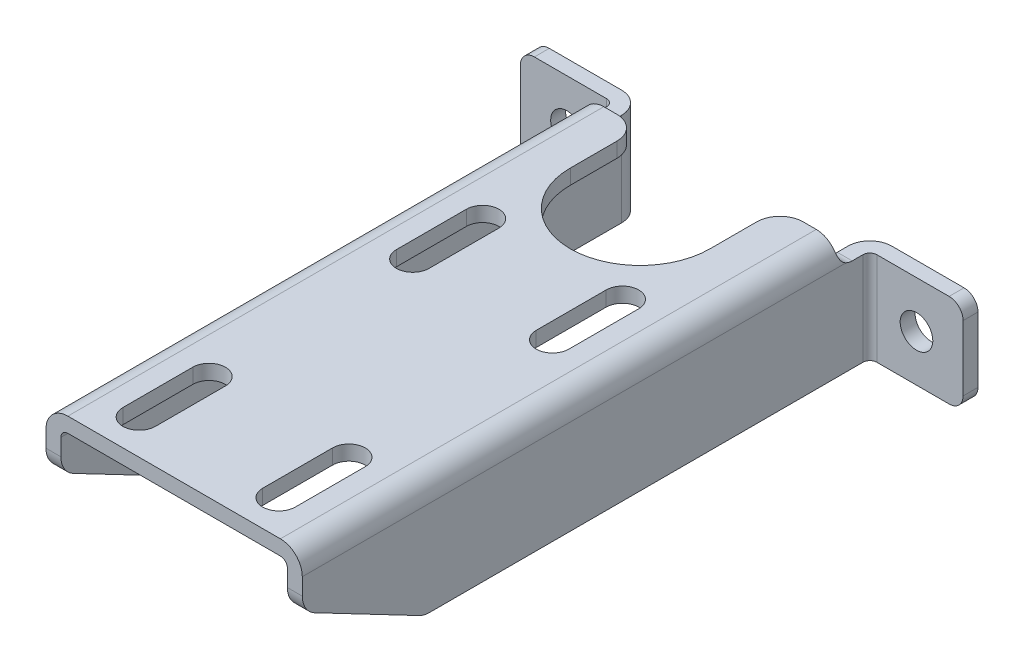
ISO-10303-21;
HEADER;
FILE_DESCRIPTION(('STEP AP214'),'2;1');
FILE_NAME('part.step','',(''),(''),'','','');
FILE_SCHEMA(('AUTOMOTIVE_DESIGN { 1 0 10303 214 1 1 1 1 }'));
ENDSEC;
DATA;
#1=APPLICATION_CONTEXT('core data for automotive mechanical design processes');
#2=APPLICATION_PROTOCOL_DEFINITION('international standard','automotive_design',2000,#1);
#3=PRODUCT_CONTEXT('',#1,'mechanical');
#4=PRODUCT('Part','Part','',(#3));
#5=PRODUCT_RELATED_PRODUCT_CATEGORY('part','',(#4));
#6=PRODUCT_DEFINITION_FORMATION('','',#4);
#7=PRODUCT_DEFINITION_CONTEXT('part definition',#1,'design');
#8=PRODUCT_DEFINITION('design','',#6,#7);
#9=PRODUCT_DEFINITION_SHAPE('','',#8);
#10=(LENGTH_UNIT() NAMED_UNIT(*) SI_UNIT(.MILLI.,.METRE.));
#11=(NAMED_UNIT(*) PLANE_ANGLE_UNIT() SI_UNIT($,.RADIAN.));
#12=(NAMED_UNIT(*) SI_UNIT($,.STERADIAN.) SOLID_ANGLE_UNIT());
#13=UNCERTAINTY_MEASURE_WITH_UNIT(LENGTH_MEASURE(1.E-05),#10,'distance_accuracy_value','');
#14=(GEOMETRIC_REPRESENTATION_CONTEXT(3) GLOBAL_UNCERTAINTY_ASSIGNED_CONTEXT((#13)) GLOBAL_UNIT_ASSIGNED_CONTEXT((#10,
#11,#12)) REPRESENTATION_CONTEXT('',''));
#15=CARTESIAN_POINT('',(0.,0.,0.));
#16=DIRECTION('',(0.,0.,1.));
#17=DIRECTION('',(1.,0.,0.));
#18=AXIS2_PLACEMENT_3D('',#15,#16,#17);
#19=CARTESIAN_POINT('',(10.,10.,0.));
#20=DIRECTION('',(1.,0.,0.));
#21=DIRECTION('',(0.,0.,1.));
#22=AXIS2_PLACEMENT_3D('',#19,#20,#21);
#23=PLANE('',#22);
#24=DIRECTION('',(0.,0.,1.));
#25=VECTOR('',#24,1.);
#26=CARTESIAN_POINT('',(10.,10.,0.));
#27=LINE('',#26,#25);
#28=CARTESIAN_POINT('',(10.,10.,4.7));
#29=VERTEX_POINT('',#28);
#30=CARTESIAN_POINT('',(10.,10.,7.));
#31=VERTEX_POINT('',#30);
#32=EDGE_CURVE('E439',#29,#31,#27,.T.);
#33=ORIENTED_EDGE('',*,*,#32,.F.);
#34=DIRECTION('',(0.,1.,0.));
#35=VECTOR('',#34,1.);
#36=CARTESIAN_POINT('',(10.,-10.,4.7));
#37=LINE('',#36,#35);
#38=CARTESIAN_POINT('',(10.,-10.,4.7));
#39=VERTEX_POINT('',#38);
#40=EDGE_CURVE('E700',#29,#39,#37,.F.);
#41=ORIENTED_EDGE('',*,*,#40,.T.);
#42=DIRECTION('',(0.,0.,1.));
#43=VECTOR('',#42,1.);
#44=CARTESIAN_POINT('',(10.,-10.,3.2));
#45=LINE('',#44,#43);
#46=CARTESIAN_POINT('',(10.,-10.,97.6611));
#47=VERTEX_POINT('',#46);
#48=EDGE_CURVE('E408',#39,#47,#45,.T.);
#49=ORIENTED_EDGE('',*,*,#48,.T.);
#50=CARTESIAN_POINT('',(10.,-5.,97.6611));
#51=DIRECTION('',(-1.,0.,0.));
#52=DIRECTION('',(0.,0.,-1.));
#53=AXIS2_PLACEMENT_3D('',#50,#51,#52);
#54=CIRCLE('',#53,5.);
#55=CARTESIAN_POINT('',(10.,-9.33093500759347,100.1597));
#56=VERTEX_POINT('',#55);
#57=EDGE_CURVE('E387',#47,#56,#54,.T.);
#58=ORIENTED_EDGE('',*,*,#57,.T.);
#59=DIRECTION('',(0.,-0.463585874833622,-0.886051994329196));
#60=VECTOR('',#59,1.);
#61=CARTESIAN_POINT('',(10.,2.35686499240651,122.4986));
#62=LINE('',#61,#60);
#63=CARTESIAN_POINT('',(10.,2.35686499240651,122.4986));
#64=VERTEX_POINT('',#63);
#65=EDGE_CURVE('E397',#64,#56,#62,.T.);
#66=ORIENTED_EDGE('',*,*,#65,.F.);
#67=CARTESIAN_POINT('',(10.,6.6878,120.));
#68=DIRECTION('',(-1.,0.,0.));
#69=DIRECTION('',(0.,0.,-1.));
#70=AXIS2_PLACEMENT_3D('',#67,#68,#69);
#71=CIRCLE('',#70,5.);
#72=CARTESIAN_POINT('',(10.,6.6878,125.));
#73=VERTEX_POINT('',#72);
#74=EDGE_CURVE('E404',#64,#73,#71,.T.);
#75=ORIENTED_EDGE('',*,*,#74,.T.);
#76=DIRECTION('',(0.,1.,0.));
#77=VECTOR('',#76,1.);
#78=CARTESIAN_POINT('',(10.,10.,125.));
#79=LINE('',#78,#77);
#80=CARTESIAN_POINT('',(10.,10.3,125.));
#81=VERTEX_POINT('',#80);
#82=EDGE_CURVE('E918',#73,#81,#79,.T.);
#83=ORIENTED_EDGE('',*,*,#82,.T.);
#84=DIRECTION('',(0.,0.,1.));
#85=VECTOR('',#84,1.);
#86=CARTESIAN_POINT('',(10.,10.3,0.));
#87=LINE('',#86,#85);
#88=CARTESIAN_POINT('',(10.,10.3,8.307669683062));
#89=VERTEX_POINT('',#88);
#90=EDGE_CURVE('E809',#89,#81,#87,.T.);
#91=ORIENTED_EDGE('',*,*,#90,.F.);
#92=CARTESIAN_POINT('',(10.,13.,7.));
#93=DIRECTION('',(1.,0.,0.));
#94=DIRECTION('',(0.,0.,1.));
#95=AXIS2_PLACEMENT_3D('',#92,#93,#94);
#96=CIRCLE('',#95,3.);
#97=EDGE_CURVE('E441',#89,#31,#96,.T.);
#98=ORIENTED_EDGE('',*,*,#97,.T.);
#99=EDGE_LOOP('',(#33,#41,#49,#58,#66,#75,#83,#91,#98));
#100=FACE_BOUND('',#99,.T.);
#101=ADVANCED_FACE('F14',(#100),#23,.F.);
#102=CARTESIAN_POINT('',(65.,10.,0.));
#103=DIRECTION('',(1.,0.,0.));
#104=DIRECTION('',(0.,0.,1.));
#105=AXIS2_PLACEMENT_3D('',#102,#103,#104);
#106=PLANE('',#105);
#107=DIRECTION('',(0.,0.,1.));
#108=VECTOR('',#107,1.);
#109=CARTESIAN_POINT('',(65.,-10.,3.2));
#110=LINE('',#109,#108);
#111=CARTESIAN_POINT('',(65.,-10.,4.7));
#112=VERTEX_POINT('',#111);
#113=CARTESIAN_POINT('',(65.,-10.,97.6611));
#114=VERTEX_POINT('',#113);
#115=EDGE_CURVE('E688',#112,#114,#110,.T.);
#116=ORIENTED_EDGE('',*,*,#115,.F.);
#117=DIRECTION('',(0.,1.,0.));
#118=VECTOR('',#117,1.);
#119=CARTESIAN_POINT('',(65.,10.,4.7));
#120=LINE('',#119,#118);
#121=CARTESIAN_POINT('',(65.,10.,4.7));
#122=VERTEX_POINT('',#121);
#123=EDGE_CURVE('E691',#112,#122,#120,.T.);
#124=ORIENTED_EDGE('',*,*,#123,.T.);
#125=DIRECTION('',(0.,0.,-1.));
#126=VECTOR('',#125,1.);
#127=CARTESIAN_POINT('',(65.,10.,0.));
#128=LINE('',#127,#126);
#129=CARTESIAN_POINT('',(65.,10.,7.));
#130=VERTEX_POINT('',#129);
#131=EDGE_CURVE('E1078',#130,#122,#128,.T.);
#132=ORIENTED_EDGE('',*,*,#131,.F.);
#133=CARTESIAN_POINT('',(65.,13.,7.));
#134=DIRECTION('',(1.,0.,0.));
#135=DIRECTION('',(0.,0.,1.));
#136=AXIS2_PLACEMENT_3D('',#133,#134,#135);
#137=CIRCLE('',#136,3.);
#138=CARTESIAN_POINT('',(65.,10.3,8.307669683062));
#139=VERTEX_POINT('',#138);
#140=EDGE_CURVE('E463',#130,#139,#137,.F.);
#141=ORIENTED_EDGE('',*,*,#140,.T.);
#142=DIRECTION('',(0.,0.,1.));
#143=VECTOR('',#142,1.);
#144=CARTESIAN_POINT('',(65.,10.3,0.));
#145=LINE('',#144,#143);
#146=CARTESIAN_POINT('',(65.,10.3,125.));
#147=VERTEX_POINT('',#146);
#148=EDGE_CURVE('E824',#139,#147,#145,.T.);
#149=ORIENTED_EDGE('',*,*,#148,.T.);
#150=DIRECTION('',(0.,1.,0.));
#151=VECTOR('',#150,1.);
#152=CARTESIAN_POINT('',(65.,10.,125.));
#153=LINE('',#152,#151);
#154=CARTESIAN_POINT('',(65.,6.6878,125.));
#155=VERTEX_POINT('',#154);
#156=EDGE_CURVE('E907',#155,#147,#153,.T.);
#157=ORIENTED_EDGE('',*,*,#156,.F.);
#158=CARTESIAN_POINT('',(65.,6.6878,120.));
#159=DIRECTION('',(1.,0.,0.));
#160=DIRECTION('',(0.,0.,1.));
#161=AXIS2_PLACEMENT_3D('',#158,#159,#160);
#162=CIRCLE('',#161,5.);
#163=CARTESIAN_POINT('',(65.,2.35686499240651,122.4986));
#164=VERTEX_POINT('',#163);
#165=EDGE_CURVE('E432',#155,#164,#162,.T.);
#166=ORIENTED_EDGE('',*,*,#165,.T.);
#167=DIRECTION('',(0.,0.463585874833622,0.886051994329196));
#168=VECTOR('',#167,1.);
#169=CARTESIAN_POINT('',(65.,-46.3182052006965,29.4659056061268));
#170=LINE('',#169,#168);
#171=CARTESIAN_POINT('',(65.,-9.33093500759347,100.1597));
#172=VERTEX_POINT('',#171);
#173=EDGE_CURVE('E437',#172,#164,#170,.T.);
#174=ORIENTED_EDGE('',*,*,#173,.F.);
#175=CARTESIAN_POINT('',(65.,-5.,97.6611));
#176=DIRECTION('',(1.,0.,0.));
#177=DIRECTION('',(0.,0.,1.));
#178=AXIS2_PLACEMENT_3D('',#175,#176,#177);
#179=CIRCLE('',#178,5.);
#180=EDGE_CURVE('E423',#172,#114,#179,.T.);
#181=ORIENTED_EDGE('',*,*,#180,.T.);
#182=EDGE_LOOP('',(#116,#124,#132,#141,#149,#157,#166,#174,#181));
#183=FACE_BOUND('',#182,.T.);
#184=ADVANCED_FACE('F662',(#183),#106,.T.);
#185=CARTESIAN_POINT('',(61.8,10.3,0.));
#186=DIRECTION('',(-1.,0.,0.));
#187=DIRECTION('',(0.,0.,-1.));
#188=AXIS2_PLACEMENT_3D('',#185,#186,#187);
#189=PLANE('',#188);
#190=DIRECTION('',(0.,0.,1.));
#191=VECTOR('',#190,1.);
#192=CARTESIAN_POINT('',(61.8,10.,0.));
#193=LINE('',#192,#191);
#194=CARTESIAN_POINT('',(61.8,10.,4.7));
#195=VERTEX_POINT('',#194);
#196=CARTESIAN_POINT('',(61.8,10.,7.));
#197=VERTEX_POINT('',#196);
#198=EDGE_CURVE('E1079',#195,#197,#193,.T.);
#199=ORIENTED_EDGE('',*,*,#198,.F.);
#200=DIRECTION('',(0.,-1.,0.));
#201=VECTOR('',#200,1.);
#202=CARTESIAN_POINT('',(61.8,10.3,4.7));
#203=LINE('',#202,#201);
#204=CARTESIAN_POINT('',(61.8,-10.,4.7));
#205=VERTEX_POINT('',#204);
#206=EDGE_CURVE('E744',#195,#205,#203,.T.);
#207=ORIENTED_EDGE('',*,*,#206,.T.);
#208=DIRECTION('',(0.,0.,1.));
#209=VECTOR('',#208,1.);
#210=CARTESIAN_POINT('',(61.8,-10.,0.));
#211=LINE('',#210,#209);
#212=CARTESIAN_POINT('',(61.8,-10.,97.6611));
#213=VERTEX_POINT('',#212);
#214=EDGE_CURVE('E839',#205,#213,#211,.T.);
#215=ORIENTED_EDGE('',*,*,#214,.T.);
#216=CARTESIAN_POINT('',(61.8,-5.,97.6611));
#217=DIRECTION('',(-1.,0.,0.));
#218=DIRECTION('',(0.,0.,-1.));
#219=AXIS2_PLACEMENT_3D('',#216,#217,#218);
#220=CIRCLE('',#219,5.);
#221=CARTESIAN_POINT('',(61.8,-9.33093500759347,100.1597));
#222=VERTEX_POINT('',#221);
#223=EDGE_CURVE('E420',#213,#222,#220,.T.);
#224=ORIENTED_EDGE('',*,*,#223,.T.);
#225=DIRECTION('',(0.,-0.463585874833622,-0.886051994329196));
#226=VECTOR('',#225,1.);
#227=CARTESIAN_POINT('',(61.8,-46.2537316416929,29.5891339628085));
#228=LINE('',#227,#226);
#229=CARTESIAN_POINT('',(61.8,2.35686499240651,122.4986));
#230=VERTEX_POINT('',#229);
#231=EDGE_CURVE('E435',#230,#222,#228,.T.);
#232=ORIENTED_EDGE('',*,*,#231,.F.);
#233=CARTESIAN_POINT('',(61.8,6.6878,120.));
#234=DIRECTION('',(-1.,0.,0.));
#235=DIRECTION('',(0.,0.,-1.));
#236=AXIS2_PLACEMENT_3D('',#233,#234,#235);
#237=CIRCLE('',#236,5.);
#238=CARTESIAN_POINT('',(61.8,6.6878,125.));
#239=VERTEX_POINT('',#238);
#240=EDGE_CURVE('E429',#230,#239,#237,.T.);
#241=ORIENTED_EDGE('',*,*,#240,.T.);
#242=DIRECTION('',(0.,-1.,0.));
#243=VECTOR('',#242,1.);
#244=CARTESIAN_POINT('',(61.8,10.3,125.));
#245=LINE('',#244,#243);
#246=CARTESIAN_POINT('',(61.8,10.3,125.));
#247=VERTEX_POINT('',#246);
#248=EDGE_CURVE('E904',#247,#239,#245,.T.);
#249=ORIENTED_EDGE('',*,*,#248,.F.);
#250=DIRECTION('',(0.,0.,1.));
#251=VECTOR('',#250,1.);
#252=CARTESIAN_POINT('',(61.8,10.3,0.));
#253=LINE('',#252,#251);
#254=CARTESIAN_POINT('',(61.8000005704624,10.3000000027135,10.));
#255=VERTEX_POINT('',#254);
#256=EDGE_CURVE('E843',#255,#247,#253,.T.);
#257=ORIENTED_EDGE('',*,*,#256,.F.);
#258=CARTESIAN_POINT('',(61.8000005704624,10.3,8.307669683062));
#259=VERTEX_POINT('',#258);
#260=EDGE_CURVE('E841',#259,#255,#253,.T.);
#261=ORIENTED_EDGE('',*,*,#260,.F.);
#262=CARTESIAN_POINT('',(61.8,13.,7.));
#263=DIRECTION('',(-1.,0.,0.));
#264=DIRECTION('',(0.,0.,-1.));
#265=AXIS2_PLACEMENT_3D('',#262,#263,#264);
#266=CIRCLE('',#265,3.);
#267=EDGE_CURVE('E460',#259,#197,#266,.F.);
#268=ORIENTED_EDGE('',*,*,#267,.T.);
#269=EDGE_LOOP('',(#199,#207,#215,#224,#232,#241,#249,#257,#261,#268));
#270=FACE_BOUND('',#269,.T.);
#271=ADVANCED_FACE('F646',(#270),#189,.T.);
#272=CARTESIAN_POINT('',(13.2,-10.,0.));
#273=DIRECTION('',(1.,0.,0.));
#274=DIRECTION('',(0.,0.,1.));
#275=AXIS2_PLACEMENT_3D('',#272,#273,#274);
#276=PLANE('',#275);
#277=DIRECTION('',(0.,0.,1.));
#278=VECTOR('',#277,1.);
#279=CARTESIAN_POINT('',(13.2,-10.,0.));
#280=LINE('',#279,#278);
#281=CARTESIAN_POINT('',(13.2,-10.,4.7));
#282=VERTEX_POINT('',#281);
#283=CARTESIAN_POINT('',(13.2,-10.,97.6611));
#284=VERTEX_POINT('',#283);
#285=EDGE_CURVE('E851',#282,#284,#280,.T.);
#286=ORIENTED_EDGE('',*,*,#285,.F.);
#287=DIRECTION('',(0.,1.,0.));
#288=VECTOR('',#287,1.);
#289=CARTESIAN_POINT('',(13.2,-10.,4.7));
#290=LINE('',#289,#288);
#291=CARTESIAN_POINT('',(13.2,10.,4.7));
#292=VERTEX_POINT('',#291);
#293=EDGE_CURVE('E735',#282,#292,#290,.T.);
#294=ORIENTED_EDGE('',*,*,#293,.T.);
#295=DIRECTION('',(0.,0.,-1.));
#296=VECTOR('',#295,1.);
#297=CARTESIAN_POINT('',(13.2,10.,0.));
#298=LINE('',#297,#296);
#299=CARTESIAN_POINT('',(13.2,10.,7.));
#300=VERTEX_POINT('',#299);
#301=EDGE_CURVE('E1081',#300,#292,#298,.T.);
#302=ORIENTED_EDGE('',*,*,#301,.F.);
#303=CARTESIAN_POINT('',(13.2,13.,7.));
#304=DIRECTION('',(1.,0.,0.));
#305=DIRECTION('',(0.,0.,1.));
#306=AXIS2_PLACEMENT_3D('',#303,#304,#305);
#307=CIRCLE('',#306,3.);
#308=CARTESIAN_POINT('',(13.200000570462,10.3,8.307669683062));
#309=VERTEX_POINT('',#308);
#310=EDGE_CURVE('E454',#300,#309,#307,.F.);
#311=ORIENTED_EDGE('',*,*,#310,.T.);
#312=DIRECTION('',(0.,0.,1.));
#313=VECTOR('',#312,1.);
#314=CARTESIAN_POINT('',(13.2000000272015,10.3,0.));
#315=LINE('',#314,#313);
#316=CARTESIAN_POINT('',(13.200000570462,10.3,10.));
#317=VERTEX_POINT('',#316);
#318=EDGE_CURVE('E848',#309,#317,#315,.T.);
#319=ORIENTED_EDGE('',*,*,#318,.T.);
#320=CARTESIAN_POINT('',(13.2000000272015,10.3,125.));
#321=VERTEX_POINT('',#320);
#322=EDGE_CURVE('E850',#317,#321,#315,.T.);
#323=ORIENTED_EDGE('',*,*,#322,.T.);
#324=DIRECTION('',(0.,1.,0.));
#325=VECTOR('',#324,1.);
#326=CARTESIAN_POINT('',(13.2,-10.,125.));
#327=LINE('',#326,#325);
#328=CARTESIAN_POINT('',(13.2000000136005,6.6878,125.));
#329=VERTEX_POINT('',#328);
#330=EDGE_CURVE('E893',#329,#321,#327,.T.);
#331=ORIENTED_EDGE('',*,*,#330,.F.);
#332=CARTESIAN_POINT('',(13.2,6.6878,120.));
#333=DIRECTION('',(1.,0.,0.));
#334=DIRECTION('',(0.,0.,1.));
#335=AXIS2_PLACEMENT_3D('',#332,#333,#334);
#336=CIRCLE('',#335,5.);
#337=CARTESIAN_POINT('',(13.2,2.35686499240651,122.4986));
#338=VERTEX_POINT('',#337);
#339=EDGE_CURVE('E426',#329,#338,#336,.T.);
#340=ORIENTED_EDGE('',*,*,#339,.T.);
#341=DIRECTION('',(0.,0.463585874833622,0.886051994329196));
#342=VECTOR('',#341,1.);
#343=CARTESIAN_POINT('',(13.2,-50.6164424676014,21.2506818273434));
#344=LINE('',#343,#342);
#345=CARTESIAN_POINT('',(13.2,-9.33093500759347,100.1597));
#346=VERTEX_POINT('',#345);
#347=EDGE_CURVE('E747',#346,#338,#344,.T.);
#348=ORIENTED_EDGE('',*,*,#347,.F.);
#349=CARTESIAN_POINT('',(13.2,-5.,97.6611));
#350=DIRECTION('',(1.,0.,0.));
#351=DIRECTION('',(0.,0.,1.));
#352=AXIS2_PLACEMENT_3D('',#349,#350,#351);
#353=CIRCLE('',#352,5.);
#354=EDGE_CURVE('E390',#346,#284,#353,.T.);
#355=ORIENTED_EDGE('',*,*,#354,.T.);
#356=EDGE_LOOP('',(#286,#294,#302,#311,#319,#323,#331,#340,#348,#355));
#357=FACE_BOUND('',#356,.T.);
#358=ADVANCED_FACE('F642',(#357),#276,.T.);
#359=CARTESIAN_POINT('',(14.7,10.3,0.));
#360=DIRECTION('',(0.,0.,1.));
#361=DIRECTION('',(0.,1.,0.));
#362=AXIS2_PLACEMENT_3D('',#359,#360,#361);
#363=CYLINDRICAL_SURFACE('',#362,4.7);
#364=CARTESIAN_POINT('',(14.7,10.3,10.));
#365=DIRECTION('',(0.,0.,-1.));
#366=DIRECTION('',(1.,0.,0.));
#367=AXIS2_PLACEMENT_3D('',#364,#365,#366);
#368=CIRCLE('',#367,4.7);
#369=CARTESIAN_POINT('',(14.7,15.,10.));
#370=VERTEX_POINT('',#369);
#371=CARTESIAN_POINT('',(10.8529231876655,13.,10.));
#372=VERTEX_POINT('',#371);
#373=EDGE_CURVE('E964',#370,#372,#368,.F.);
#374=ORIENTED_EDGE('',*,*,#373,.T.);
#375=CARTESIAN_POINT('',(14.7,15.,9.2360679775));
#376=CARTESIAN_POINT('',(14.6353401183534,15.0000015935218,9.23605948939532));
#377=CARTESIAN_POINT('',(14.5706940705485,14.9986652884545,9.23726246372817));
#378=CARTESIAN_POINT('',(14.4416133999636,14.9933363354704,9.24201460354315));
#379=CARTESIAN_POINT('',(14.3771787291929,14.9893443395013,9.24556319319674));
#380=CARTESIAN_POINT('',(14.1847895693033,14.9734435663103,9.25958629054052));
#381=CARTESIAN_POINT('',(14.0573758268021,14.9576097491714,9.27343899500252));
#382=CARTESIAN_POINT('',(13.8062703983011,14.9159881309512,9.30861727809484));
#383=CARTESIAN_POINT('',(13.6825584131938,14.8902733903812,9.32988790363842));
#384=CARTESIAN_POINT('',(13.4385681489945,14.8293064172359,9.37805496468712));
#385=CARTESIAN_POINT('',(13.3182923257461,14.7940475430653,9.40495531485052));
#386=CARTESIAN_POINT('',(13.0715224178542,14.7109454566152,9.46485382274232));
#387=CARTESIAN_POINT('',(12.9453846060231,14.6622800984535,9.49817758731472));
#388=CARTESIAN_POINT('',(12.6982160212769,14.5545327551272,9.56661412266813));
#389=CARTESIAN_POINT('',(12.5771854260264,14.4954504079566,9.60172695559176));
#390=CARTESIAN_POINT('',(12.2217764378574,14.3026380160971,9.70638327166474));
#391=CARTESIAN_POINT('',(11.9952525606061,14.1534007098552,9.77519681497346));
#392=CARTESIAN_POINT('',(11.6224775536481,13.8580921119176,9.87776359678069));
#393=CARTESIAN_POINT('',(11.4704618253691,13.7208662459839,9.91598260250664));
#394=CARTESIAN_POINT('',(11.2557548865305,13.4996458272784,9.95905117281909));
#395=CARTESIAN_POINT('',(11.1864511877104,13.4234034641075,9.97102714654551));
#396=CARTESIAN_POINT('',(11.0526931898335,13.2661077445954,9.98922236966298));
#397=CARTESIAN_POINT('',(10.9882378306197,13.1850554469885,9.99544288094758));
#398=CARTESIAN_POINT('',(10.8771758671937,13.0354820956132,10.0005260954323));
#399=CARTESIAN_POINT('',(10.829590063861,12.9677276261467,10.0006190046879));
#400=CARTESIAN_POINT('',(10.7381388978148,12.8299189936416,9.99596778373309));
#401=CARTESIAN_POINT('',(10.6942726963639,12.759865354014,9.99122474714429));
#402=CARTESIAN_POINT('',(10.6105123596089,12.6179474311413,9.97642831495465));
#403=CARTESIAN_POINT('',(10.5706186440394,12.546082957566,9.96637435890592));
#404=CARTESIAN_POINT('',(10.4950506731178,12.4012072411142,9.94055395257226));
#405=CARTESIAN_POINT('',(10.4593743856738,12.3281965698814,9.92479026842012));
#406=CARTESIAN_POINT('',(10.3921617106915,12.1812490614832,9.88711543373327));
#407=CARTESIAN_POINT('',(10.3606533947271,12.1073092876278,9.86516543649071));
#408=CARTESIAN_POINT('',(10.3021279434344,11.9598235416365,9.81497756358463));
#409=CARTESIAN_POINT('',(10.2751089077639,11.8862774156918,9.78674236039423));
#410=CARTESIAN_POINT('',(10.2255020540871,11.7404162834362,9.72392159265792));
#411=CARTESIAN_POINT('',(10.2029137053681,11.6681011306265,9.68933678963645));
#412=CARTESIAN_POINT('',(10.1619987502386,11.5255821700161,9.6139250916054));
#413=CARTESIAN_POINT('',(10.1436718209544,11.4553782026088,9.57309866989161));
#414=CARTESIAN_POINT('',(10.0978023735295,11.2623128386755,9.44992066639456));
#415=CARTESIAN_POINT('',(10.0747628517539,11.1426908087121,9.36065193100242));
#416=CARTESIAN_POINT('',(10.0393027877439,10.9172486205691,9.164380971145));
#417=CARTESIAN_POINT('',(10.0268886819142,10.8114368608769,9.05736804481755));
#418=CARTESIAN_POINT('',(10.0110192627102,10.632046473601,8.84631065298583));
#419=CARTESIAN_POINT('',(10.0064659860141,10.5560149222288,8.74442238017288));
#420=CARTESIAN_POINT('',(10.0023368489,10.4521777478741,8.58512403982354));
#421=CARTESIAN_POINT('',(10.0014102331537,10.4192913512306,8.53099707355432));
#422=CARTESIAN_POINT('',(10.0002430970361,10.3570035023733,8.42076588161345));
#423=CARTESIAN_POINT('',(10.0000025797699,10.3276020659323,8.36466164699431));
#424=CARTESIAN_POINT('',(10.,10.3,8.307669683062));
#425=B_SPLINE_CURVE_WITH_KNOTS('',3,(#375,#376,#377,#378,#379,#380,#381,#382,#383,#384,#385,
#386,#387,#388,#389,#390,#391,#392,#393,#394,#395,#396,#397,#398,#399,#400,#401,#402,#403,#404,
#405,#406,#407,#408,#409,#410,#411,#412,#413,#414,#415,#416,#417,#418,#419,#420,#421,#422,#423,
#424),.UNSPECIFIED.,.F.,.F.,(4,2,2,2,2,2,2,2,2,2,2,2,2,2,2,2,2,2,2,2,2,2,2,2,4),(0.,
0.193928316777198,0.387809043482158,0.774454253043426,1.15829393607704,1.54240141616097,
1.95958148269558,2.37677604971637,3.21172107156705,3.83434425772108,4.14520140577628,
4.45599038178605,4.7041442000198,4.95224191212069,5.20036581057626,5.44836966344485,
5.69796693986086,5.94745828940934,6.196919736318,6.44636227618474,6.89716106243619,
7.34823272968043,7.72871508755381,7.91862450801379,8.10853478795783),.UNSPECIFIED.);
#426=EDGE_CURVE('E474',#372,#89,#425,.T.);
#427=ORIENTED_EDGE('',*,*,#426,.T.);
#428=ORIENTED_EDGE('',*,*,#90,.T.);
#429=CARTESIAN_POINT('',(14.7,10.3,125.));
#430=DIRECTION('',(0.,0.,1.));
#431=DIRECTION('',(0.,1.,0.));
#432=AXIS2_PLACEMENT_3D('',#429,#430,#431);
#433=CIRCLE('',#432,4.7);
#434=CARTESIAN_POINT('',(14.7,15.,125.));
#435=VERTEX_POINT('',#434);
#436=EDGE_CURVE('E915',#435,#81,#433,.T.);
#437=ORIENTED_EDGE('',*,*,#436,.F.);
#438=DIRECTION('',(0.,0.,1.));
#439=VECTOR('',#438,1.);
#440=CARTESIAN_POINT('',(14.7,15.,0.));
#441=LINE('',#440,#439);
#442=EDGE_CURVE('E820',#370,#435,#441,.T.);
#443=ORIENTED_EDGE('',*,*,#442,.F.);
#444=EDGE_LOOP('',(#374,#427,#428,#437,#443));
#445=FACE_BOUND('',#444,.T.);
#446=ADVANCED_FACE('F645',(#445),#363,.T.);
#447=CARTESIAN_POINT('',(60.3,10.3,0.));
#448=DIRECTION('',(0.,0.,1.));
#449=DIRECTION('',(0.,1.,0.));
#450=AXIS2_PLACEMENT_3D('',#447,#448,#449);
#451=CYLINDRICAL_SURFACE('',#450,4.7);
#452=CARTESIAN_POINT('',(64.1470768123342,13.,10.));
#453=CARTESIAN_POINT('',(64.1928933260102,12.934742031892,10.0000076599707));
#454=CARTESIAN_POINT('',(64.2370418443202,12.8682825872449,9.99787050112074));
#455=CARTESIAN_POINT('',(64.3218047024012,12.7333932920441,9.98889305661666));
#456=CARTESIAN_POINT('',(64.3624165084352,12.6649620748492,9.98204942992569));
#457=CARTESIAN_POINT('',(64.4399108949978,12.5265328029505,9.96322764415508));
#458=CARTESIAN_POINT('',(64.4767867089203,12.4565321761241,9.95124036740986));
#459=CARTESIAN_POINT('',(64.5465383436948,12.315708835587,9.92180040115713));
#460=CARTESIAN_POINT('',(64.5794151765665,12.2448863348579,9.90434909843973));
#461=CARTESIAN_POINT('',(64.6412080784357,12.1027602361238,9.86364260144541));
#462=CARTESIAN_POINT('',(64.6701052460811,12.0314559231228,9.84036109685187));
#463=CARTESIAN_POINT('',(64.7237429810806,11.8894224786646,9.78789381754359));
#464=CARTESIAN_POINT('',(64.7484819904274,11.8186935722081,9.75870583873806));
#465=CARTESIAN_POINT('',(64.7938121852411,11.6787837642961,9.69449325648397));
#466=CARTESIAN_POINT('',(64.8144131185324,11.6095995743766,9.65948273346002));
#467=CARTESIAN_POINT('',(64.8517265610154,11.4733646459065,9.58369400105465));
#468=CARTESIAN_POINT('',(64.8684376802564,11.4063146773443,9.54291373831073));
#469=CARTESIAN_POINT('',(64.9111874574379,11.2180025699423,9.4178717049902));
#470=CARTESIAN_POINT('',(64.9327153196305,11.1002535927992,9.32661577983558));
#471=CARTESIAN_POINT('',(64.9655740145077,10.8788097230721,9.12670526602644));
#472=CARTESIAN_POINT('',(64.9768911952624,10.775133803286,9.01802761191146));
#473=CARTESIAN_POINT('',(64.9906763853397,10.6053007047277,8.81089296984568));
#474=CARTESIAN_POINT('',(64.9945158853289,10.5358558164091,8.7151901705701));
#475=CARTESIAN_POINT('',(64.9991611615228,10.4088642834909,8.51655005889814));
#476=CARTESIAN_POINT('',(64.9999765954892,10.3512803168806,8.41363684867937));
#477=CARTESIAN_POINT('',(65.,10.3,8.307669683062));
#478=B_SPLINE_CURVE_WITH_KNOTS('',3,(#452,#453,#454,#455,#456,#457,#458,#459,#460,#461,#462,
#463,#464,#465,#466,#467,#468,#469,#470,#471,#472,#473,#474,#475,#476,#477),.UNSPECIFIED.,.F.,
.F.,(4,2,2,2,2,2,2,2,2,2,2,2,4),(0.,0.239188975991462,0.478547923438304,0.718332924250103,
0.95805711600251,1.19888326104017,1.43979944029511,1.68014127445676,1.92056885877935,
2.36988949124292,2.81980998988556,3.17389001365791,3.52683825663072),.UNSPECIFIED.);
#479=CARTESIAN_POINT('',(64.1470768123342,13.,10.));
#480=VERTEX_POINT('',#479);
#481=EDGE_CURVE('E466',#480,#139,#478,.T.);
#482=ORIENTED_EDGE('',*,*,#481,.F.);
#483=CARTESIAN_POINT('',(60.3,10.3,10.));
#484=DIRECTION('',(0.,0.,1.));
#485=DIRECTION('',(-1.,0.,0.));
#486=AXIS2_PLACEMENT_3D('',#483,#484,#485);
#487=CIRCLE('',#486,4.7);
#488=CARTESIAN_POINT('',(60.3,15.,10.));
#489=VERTEX_POINT('',#488);
#490=EDGE_CURVE('E959',#480,#489,#487,.T.);
#491=ORIENTED_EDGE('',*,*,#490,.T.);
#492=DIRECTION('',(0.,0.,1.));
#493=VECTOR('',#492,1.);
#494=CARTESIAN_POINT('',(60.3,15.,0.));
#495=LINE('',#494,#493);
#496=CARTESIAN_POINT('',(60.3,15.,125.));
#497=VERTEX_POINT('',#496);
#498=EDGE_CURVE('E822',#489,#497,#495,.T.);
#499=ORIENTED_EDGE('',*,*,#498,.T.);
#500=CARTESIAN_POINT('',(60.3,10.3,125.));
#501=DIRECTION('',(0.,0.,-1.));
#502=DIRECTION('',(0.,-1.,0.));
#503=AXIS2_PLACEMENT_3D('',#500,#501,#502);
#504=CIRCLE('',#503,4.7);
#505=EDGE_CURVE('E909',#497,#147,#504,.T.);
#506=ORIENTED_EDGE('',*,*,#505,.T.);
#507=ORIENTED_EDGE('',*,*,#148,.F.);
#508=EDGE_LOOP('',(#482,#491,#499,#506,#507));
#509=FACE_BOUND('',#508,.T.);
#510=ADVANCED_FACE('F480',(#509),#451,.T.);
#511=CARTESIAN_POINT('',(61.800000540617,26.800000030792,10.));
#512=DIRECTION('',(-1.,-1.80881138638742E-09,0.));
#513=DIRECTION('',(-1.80881138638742E-09,1.,0.));
#514=AXIS2_PLACEMENT_3D('',#511,#512,#513);
#515=PLANE('',#514);
#516=DIRECTION('',(1.80881138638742E-09,-1.,0.));
#517=VECTOR('',#516,1.);
#518=CARTESIAN_POINT('',(61.800000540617,26.800000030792,10.));
#519=LINE('',#518,#517);
#520=CARTESIAN_POINT('',(61.8000005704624,13.,10.));
#521=VERTEX_POINT('',#520);
#522=EDGE_CURVE('E993',#521,#255,#519,.T.);
#523=ORIENTED_EDGE('',*,*,#522,.F.);
#524=CARTESIAN_POINT('',(61.8000005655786,13.,7.));
#525=DIRECTION('',(-1.,-1.80881138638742E-09,0.));
#526=DIRECTION('',(-1.80881138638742E-09,1.,0.));
#527=AXIS2_PLACEMENT_3D('',#524,#525,#526);
#528=CIRCLE('',#527,3.);
#529=EDGE_CURVE('E457',#521,#259,#528,.F.);
#530=ORIENTED_EDGE('',*,*,#529,.T.);
#531=ORIENTED_EDGE('',*,*,#260,.T.);
#532=EDGE_LOOP('',(#523,#530,#531));
#533=FACE_BOUND('',#532,.T.);
#534=ADVANCED_FACE('F562',(#533),#515,.T.);
#535=CARTESIAN_POINT('',(13.200000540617,26.799999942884,10.));
#536=DIRECTION('',(-1.,-1.80881138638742E-09,0.));
#537=DIRECTION('',(-1.80881138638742E-09,1.,0.));
#538=AXIS2_PLACEMENT_3D('',#535,#536,#537);
#539=PLANE('',#538);
#540=CARTESIAN_POINT('',(13.2000005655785,13.,7.));
#541=DIRECTION('',(-1.,-1.80881138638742E-09,0.));
#542=DIRECTION('',(-1.80881138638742E-09,1.,0.));
#543=AXIS2_PLACEMENT_3D('',#540,#541,#542);
#544=CIRCLE('',#543,3.);
#545=CARTESIAN_POINT('',(13.2000005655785,13.,10.));
#546=VERTEX_POINT('',#545);
#547=EDGE_CURVE('E452',#546,#309,#544,.F.);
#548=ORIENTED_EDGE('',*,*,#547,.F.);
#549=DIRECTION('',(1.80881138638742E-09,-1.,0.));
#550=VECTOR('',#549,1.);
#551=CARTESIAN_POINT('',(13.200000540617,26.799999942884,10.));
#552=LINE('',#551,#550);
#553=EDGE_CURVE('E974',#546,#317,#552,.T.);
#554=ORIENTED_EDGE('',*,*,#553,.T.);
#555=ORIENTED_EDGE('',*,*,#318,.F.);
#556=EDGE_LOOP('',(#548,#554,#555));
#557=FACE_BOUND('',#556,.T.);
#558=ADVANCED_FACE('F558',(#557),#539,.F.);
#559=CARTESIAN_POINT('',(14.7,15.,0.));
#560=DIRECTION('',(0.,-1.,0.));
#561=DIRECTION('',(0.,0.,1.));
#562=AXIS2_PLACEMENT_3D('',#559,#560,#561);
#563=PLANE('',#562);
#564=CARTESIAN_POINT('',(52.5,15.,117.5));
#565=DIRECTION('',(0.,-1.,0.));
#566=DIRECTION('',(0.,0.,1.));
#567=AXIS2_PLACEMENT_3D('',#564,#565,#566);
#568=CIRCLE('',#567,3.5);
#569=CARTESIAN_POINT('',(56.,15.,117.5));
#570=VERTEX_POINT('',#569);
#571=CARTESIAN_POINT('',(49.,15.,117.5));
#572=VERTEX_POINT('',#571);
#573=EDGE_CURVE('E1034',#570,#572,#568,.T.);
#574=ORIENTED_EDGE('',*,*,#573,.T.);
#575=DIRECTION('',(0.,0.,-1.));
#576=VECTOR('',#575,1.);
#577=CARTESIAN_POINT('',(49.,15.,117.5));
#578=LINE('',#577,#576);
#579=CARTESIAN_POINT('',(49.,15.,102.5));
#580=VERTEX_POINT('',#579);
#581=EDGE_CURVE('E1031',#572,#580,#578,.T.);
#582=ORIENTED_EDGE('',*,*,#581,.T.);
#583=CARTESIAN_POINT('',(52.5,15.,102.5));
#584=DIRECTION('',(0.,-1.,0.));
#585=DIRECTION('',(0.,0.,1.));
#586=AXIS2_PLACEMENT_3D('',#583,#584,#585);
#587=CIRCLE('',#586,3.5);
#588=CARTESIAN_POINT('',(56.,15.,102.5));
#589=VERTEX_POINT('',#588);
#590=EDGE_CURVE('E1028',#580,#589,#587,.T.);
#591=ORIENTED_EDGE('',*,*,#590,.T.);
#592=DIRECTION('',(0.,0.,-1.));
#593=VECTOR('',#592,1.);
#594=CARTESIAN_POINT('',(56.,15.,117.5));
#595=LINE('',#594,#593);
#596=EDGE_CURVE('E1025',#570,#589,#595,.T.);
#597=ORIENTED_EDGE('',*,*,#596,.F.);
#598=EDGE_LOOP('',(#574,#582,#591,#597));
#599=FACE_BOUND('',#598,.T.);
#600=DIRECTION('',(0.,0.,-1.));
#601=VECTOR('',#600,1.);
#602=CARTESIAN_POINT('',(26.,15.,117.5));
#603=LINE('',#602,#601);
#604=CARTESIAN_POINT('',(26.,15.,117.5));
#605=VERTEX_POINT('',#604);
#606=CARTESIAN_POINT('',(26.,15.,102.5));
#607=VERTEX_POINT('',#606);
#608=EDGE_CURVE('E1011',#605,#607,#603,.T.);
#609=ORIENTED_EDGE('',*,*,#608,.F.);
#610=CARTESIAN_POINT('',(22.5,15.,117.5));
#611=DIRECTION('',(0.,1.,0.));
#612=DIRECTION('',(0.,0.,-1.));
#613=AXIS2_PLACEMENT_3D('',#610,#611,#612);
#614=CIRCLE('',#613,3.5);
#615=CARTESIAN_POINT('',(19.,15.,117.5));
#616=VERTEX_POINT('',#615);
#617=EDGE_CURVE('E1014',#616,#605,#614,.T.);
#618=ORIENTED_EDGE('',*,*,#617,.F.);
#619=DIRECTION('',(0.,0.,-1.));
#620=VECTOR('',#619,1.);
#621=CARTESIAN_POINT('',(19.,15.,117.5));
#622=LINE('',#621,#620);
#623=CARTESIAN_POINT('',(19.,15.,102.5));
#624=VERTEX_POINT('',#623);
#625=EDGE_CURVE('E1005',#616,#624,#622,.T.);
#626=ORIENTED_EDGE('',*,*,#625,.T.);
#627=CARTESIAN_POINT('',(22.5,15.,102.5));
#628=DIRECTION('',(0.,1.,0.));
#629=DIRECTION('',(0.,0.,-1.));
#630=AXIS2_PLACEMENT_3D('',#627,#628,#629);
#631=CIRCLE('',#630,3.5);
#632=EDGE_CURVE('E1008',#607,#624,#631,.T.);
#633=ORIENTED_EDGE('',*,*,#632,.F.);
#634=EDGE_LOOP('',(#609,#618,#626,#633));
#635=FACE_BOUND('',#634,.T.);
#636=DIRECTION('',(1.,0.,0.));
#637=VECTOR('',#636,1.);
#638=CARTESIAN_POINT('',(14.7,15.,10.));
#639=LINE('',#638,#637);
#640=CARTESIAN_POINT('',(17.500000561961,15.,10.));
#641=VERTEX_POINT('',#640);
#642=EDGE_CURVE('E966',#370,#641,#639,.T.);
#643=ORIENTED_EDGE('',*,*,#642,.F.);
#644=ORIENTED_EDGE('',*,*,#442,.T.);
#645=DIRECTION('',(1.,0.,0.));
#646=VECTOR('',#645,1.);
#647=CARTESIAN_POINT('',(14.7,15.,125.));
#648=LINE('',#647,#646);
#649=EDGE_CURVE('E912',#435,#497,#648,.T.);
#650=ORIENTED_EDGE('',*,*,#649,.T.);
#651=ORIENTED_EDGE('',*,*,#498,.F.);
#652=DIRECTION('',(-1.,0.,0.));
#653=VECTOR('',#652,1.);
#654=CARTESIAN_POINT('',(14.7,15.,10.));
#655=LINE('',#654,#653);
#656=CARTESIAN_POINT('',(57.500000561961,15.,10.));
#657=VERTEX_POINT('',#656);
#658=EDGE_CURVE('E956',#489,#657,#655,.T.);
#659=ORIENTED_EDGE('',*,*,#658,.T.);
#660=CARTESIAN_POINT('',(57.5000005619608,15.,15.));
#661=DIRECTION('',(0.,-1.,0.));
#662=DIRECTION('',(0.,0.,1.));
#663=AXIS2_PLACEMENT_3D('',#660,#661,#662);
#664=CIRCLE('',#663,5.);
#665=CARTESIAN_POINT('',(52.5000005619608,15.,15.));
#666=VERTEX_POINT('',#665);
#667=EDGE_CURVE('E954',#666,#657,#664,.T.);
#668=ORIENTED_EDGE('',*,*,#667,.F.);
#669=DIRECTION('',(0.,0.,-1.));
#670=VECTOR('',#669,1.);
#671=CARTESIAN_POINT('',(52.5000005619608,15.,0.));
#672=LINE('',#671,#670);
#673=CARTESIAN_POINT('',(52.5000005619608,15.,25.));
#674=VERTEX_POINT('',#673);
#675=EDGE_CURVE('E952',#674,#666,#672,.T.);
#676=ORIENTED_EDGE('',*,*,#675,.F.);
#677=CARTESIAN_POINT('',(37.5000005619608,15.,25.));
#678=DIRECTION('',(0.,-1.,0.));
#679=DIRECTION('',(0.,0.,1.));
#680=AXIS2_PLACEMENT_3D('',#677,#678,#679);
#681=CIRCLE('',#680,15.);
#682=CARTESIAN_POINT('',(22.5000005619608,15.,25.));
#683=VERTEX_POINT('',#682);
#684=EDGE_CURVE('E949',#674,#683,#681,.T.);
#685=ORIENTED_EDGE('',*,*,#684,.T.);
#686=DIRECTION('',(0.,0.,-1.));
#687=VECTOR('',#686,1.);
#688=CARTESIAN_POINT('',(22.5000005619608,15.,0.));
#689=LINE('',#688,#687);
#690=CARTESIAN_POINT('',(22.5000005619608,15.,15.));
#691=VERTEX_POINT('',#690);
#692=EDGE_CURVE('E946',#683,#691,#689,.T.);
#693=ORIENTED_EDGE('',*,*,#692,.T.);
#694=CARTESIAN_POINT('',(17.500000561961,15.,15.));
#695=DIRECTION('',(0.,-1.,0.));
#696=DIRECTION('',(0.,0.,1.));
#697=AXIS2_PLACEMENT_3D('',#694,#695,#696);
#698=CIRCLE('',#697,5.);
#699=EDGE_CURVE('E695',#691,#641,#698,.F.);
#700=ORIENTED_EDGE('',*,*,#699,.T.);
#701=EDGE_LOOP('',(#643,#644,#650,#651,#659,#668,#676,#685,#693,#700));
#702=FACE_BOUND('',#701,.T.);
#703=DIRECTION('',(0.,0.,-1.));
#704=VECTOR('',#703,1.);
#705=CARTESIAN_POINT('',(19.,15.,58.8));
#706=LINE('',#705,#704);
#707=CARTESIAN_POINT('',(19.,15.,58.8));
#708=VERTEX_POINT('',#707);
#709=CARTESIAN_POINT('',(19.,15.,43.8));
#710=VERTEX_POINT('',#709);
#711=EDGE_CURVE('E1052',#708,#710,#706,.T.);
#712=ORIENTED_EDGE('',*,*,#711,.T.);
#713=CARTESIAN_POINT('',(22.5,15.,43.8));
#714=DIRECTION('',(0.,1.,0.));
#715=DIRECTION('',(0.,0.,-1.));
#716=AXIS2_PLACEMENT_3D('',#713,#714,#715);
#717=CIRCLE('',#716,3.5);
#718=CARTESIAN_POINT('',(26.,15.,43.8));
#719=VERTEX_POINT('',#718);
#720=EDGE_CURVE('E1055',#719,#710,#717,.T.);
#721=ORIENTED_EDGE('',*,*,#720,.F.);
#722=DIRECTION('',(0.,0.,-1.));
#723=VECTOR('',#722,1.);
#724=CARTESIAN_POINT('',(26.,15.,58.8));
#725=LINE('',#724,#723);
#726=CARTESIAN_POINT('',(26.,15.,58.8));
#727=VERTEX_POINT('',#726);
#728=EDGE_CURVE('E1046',#727,#719,#725,.T.);
#729=ORIENTED_EDGE('',*,*,#728,.F.);
#730=CARTESIAN_POINT('',(22.5,15.,58.8));
#731=DIRECTION('',(0.,1.,0.));
#732=DIRECTION('',(0.,0.,-1.));
#733=AXIS2_PLACEMENT_3D('',#730,#731,#732);
#734=CIRCLE('',#733,3.5);
#735=EDGE_CURVE('E1049',#708,#727,#734,.T.);
#736=ORIENTED_EDGE('',*,*,#735,.F.);
#737=EDGE_LOOP('',(#712,#721,#729,#736));
#738=FACE_BOUND('',#737,.T.);
#739=CARTESIAN_POINT('',(52.5,15.,43.8));
#740=DIRECTION('',(0.,-1.,0.));
#741=DIRECTION('',(0.,0.,1.));
#742=AXIS2_PLACEMENT_3D('',#739,#740,#741);
#743=CIRCLE('',#742,3.5);
#744=CARTESIAN_POINT('',(49.,15.,43.8));
#745=VERTEX_POINT('',#744);
#746=CARTESIAN_POINT('',(56.,15.,43.8));
#747=VERTEX_POINT('',#746);
#748=EDGE_CURVE('E1075',#745,#747,#743,.T.);
#749=ORIENTED_EDGE('',*,*,#748,.T.);
#750=DIRECTION('',(0.,0.,-1.));
#751=VECTOR('',#750,1.);
#752=CARTESIAN_POINT('',(56.,15.,58.8));
#753=LINE('',#752,#751);
#754=CARTESIAN_POINT('',(56.,15.,58.8));
#755=VERTEX_POINT('',#754);
#756=EDGE_CURVE('E1072',#755,#747,#753,.T.);
#757=ORIENTED_EDGE('',*,*,#756,.F.);
#758=CARTESIAN_POINT('',(52.5,15.,58.8));
#759=DIRECTION('',(0.,-1.,0.));
#760=DIRECTION('',(0.,0.,1.));
#761=AXIS2_PLACEMENT_3D('',#758,#759,#760);
#762=CIRCLE('',#761,3.5);
#763=CARTESIAN_POINT('',(49.,15.,58.8));
#764=VERTEX_POINT('',#763);
#765=EDGE_CURVE('E1069',#755,#764,#762,.T.);
#766=ORIENTED_EDGE('',*,*,#765,.T.);
#767=DIRECTION('',(0.,0.,-1.));
#768=VECTOR('',#767,1.);
#769=CARTESIAN_POINT('',(49.,15.,58.8));
#770=LINE('',#769,#768);
#771=EDGE_CURVE('E1066',#764,#745,#770,.T.);
#772=ORIENTED_EDGE('',*,*,#771,.T.);
#773=EDGE_LOOP('',(#749,#757,#766,#772));
#774=FACE_BOUND('',#773,.T.);
#775=ADVANCED_FACE('F561',(#599,#635,#702,#738,#774),#563,.F.);
#776=CARTESIAN_POINT('',(14.700000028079,11.799999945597,0.));
#777=DIRECTION('',(1.80881138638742E-09,-1.,0.));
#778=DIRECTION('',(-1.,-1.80881138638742E-09,0.));
#779=AXIS2_PLACEMENT_3D('',#776,#777,#778);
#780=PLANE('',#779);
#781=DIRECTION('',(0.,0.,1.));
#782=VECTOR('',#781,1.);
#783=CARTESIAN_POINT('',(49.,11.8000000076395,0.));
#784=LINE('',#783,#782);
#785=CARTESIAN_POINT('',(49.,11.8000000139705,102.5));
#786=VERTEX_POINT('',#785);
#787=CARTESIAN_POINT('',(49.,11.8000000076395,117.5));
#788=VERTEX_POINT('',#787);
#789=EDGE_CURVE('E775',#786,#788,#784,.T.);
#790=ORIENTED_EDGE('',*,*,#789,.T.);
#791=CARTESIAN_POINT('',(52.5,11.8000000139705,117.5));
#792=DIRECTION('',(1.80881138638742E-09,-1.,0.));
#793=DIRECTION('',(-1.,-1.80881138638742E-09,0.));
#794=AXIS2_PLACEMENT_3D('',#791,#792,#793);
#795=CIRCLE('',#794,3.5);
#796=CARTESIAN_POINT('',(56.,11.800000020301,117.5));
#797=VERTEX_POINT('',#796);
#798=EDGE_CURVE('E772',#788,#797,#795,.F.);
#799=ORIENTED_EDGE('',*,*,#798,.T.);
#800=DIRECTION('',(0.,0.,1.));
#801=VECTOR('',#800,1.);
#802=CARTESIAN_POINT('',(56.,11.800000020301,0.));
#803=LINE('',#802,#801);
#804=CARTESIAN_POINT('',(56.,11.800000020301,102.5));
#805=VERTEX_POINT('',#804);
#806=EDGE_CURVE('E781',#805,#797,#803,.T.);
#807=ORIENTED_EDGE('',*,*,#806,.F.);
#808=CARTESIAN_POINT('',(52.5,11.8000000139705,102.5));
#809=DIRECTION('',(1.80881138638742E-09,-1.,0.));
#810=DIRECTION('',(-1.,-1.80881138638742E-09,0.));
#811=AXIS2_PLACEMENT_3D('',#808,#809,#810);
#812=CIRCLE('',#811,3.5);
#813=EDGE_CURVE('E778',#805,#786,#812,.F.);
#814=ORIENTED_EDGE('',*,*,#813,.T.);
#815=EDGE_LOOP('',(#790,#799,#807,#814));
#816=FACE_BOUND('',#815,.T.);
#817=CARTESIAN_POINT('',(22.5,11.799999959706,117.5));
#818=DIRECTION('',(1.80881138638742E-09,-1.,0.));
#819=DIRECTION('',(-1.,-1.80881138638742E-09,0.));
#820=AXIS2_PLACEMENT_3D('',#817,#818,#819);
#821=CIRCLE('',#820,3.5);
#822=CARTESIAN_POINT('',(26.,11.799999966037,117.5));
#823=VERTEX_POINT('',#822);
#824=CARTESIAN_POINT('',(19.,11.799999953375,117.5));
#825=VERTEX_POINT('',#824);
#826=EDGE_CURVE('E783',#823,#825,#821,.T.);
#827=ORIENTED_EDGE('',*,*,#826,.F.);
#828=DIRECTION('',(0.,0.,1.));
#829=VECTOR('',#828,1.);
#830=CARTESIAN_POINT('',(26.,11.799999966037,0.));
#831=LINE('',#830,#829);
#832=CARTESIAN_POINT('',(26.,11.799999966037,102.5));
#833=VERTEX_POINT('',#832);
#834=EDGE_CURVE('E791',#833,#823,#831,.T.);
#835=ORIENTED_EDGE('',*,*,#834,.F.);
#836=CARTESIAN_POINT('',(22.5,11.799999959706,102.5));
#837=DIRECTION('',(1.80881138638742E-09,-1.,0.));
#838=DIRECTION('',(-1.,-1.80881138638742E-09,0.));
#839=AXIS2_PLACEMENT_3D('',#836,#837,#838);
#840=CIRCLE('',#839,3.5);
#841=CARTESIAN_POINT('',(19.,11.799999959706,102.5));
#842=VERTEX_POINT('',#841);
#843=EDGE_CURVE('E788',#842,#833,#840,.T.);
#844=ORIENTED_EDGE('',*,*,#843,.F.);
#845=DIRECTION('',(0.,0.,1.));
#846=VECTOR('',#845,1.);
#847=CARTESIAN_POINT('',(18.9999999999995,11.799999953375,0.));
#848=LINE('',#847,#846);
#849=EDGE_CURVE('E785',#842,#825,#848,.T.);
#850=ORIENTED_EDGE('',*,*,#849,.T.);
#851=EDGE_LOOP('',(#827,#835,#844,#850));
#852=FACE_BOUND('',#851,.T.);
#853=DIRECTION('',(0.,0.,1.));
#854=VECTOR('',#853,1.);
#855=CARTESIAN_POINT('',(14.700000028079,11.799999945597,0.));
#856=LINE('',#855,#854);
#857=CARTESIAN_POINT('',(14.700000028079,11.799999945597,10.));
#858=VERTEX_POINT('',#857);
#859=CARTESIAN_POINT('',(14.700000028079,11.799999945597,125.));
#860=VERTEX_POINT('',#859);
#861=EDGE_CURVE('E846',#858,#860,#856,.T.);
#862=ORIENTED_EDGE('',*,*,#861,.F.);
#863=DIRECTION('',(1.,1.80881138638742E-09,0.));
#864=VECTOR('',#863,1.);
#865=CARTESIAN_POINT('',(14.700000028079,11.799999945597,10.));
#866=LINE('',#865,#864);
#867=CARTESIAN_POINT('',(17.500000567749,11.799999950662,10.));
#868=VERTEX_POINT('',#867);
#869=EDGE_CURVE('E968',#858,#868,#866,.T.);
#870=ORIENTED_EDGE('',*,*,#869,.T.);
#871=CARTESIAN_POINT('',(17.500000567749,11.799999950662,15.));
#872=DIRECTION('',(1.80881138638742E-09,-1.,0.));
#873=DIRECTION('',(-1.,-1.80881138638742E-09,0.));
#874=AXIS2_PLACEMENT_3D('',#871,#872,#873);
#875=CIRCLE('',#874,5.);
#876=CARTESIAN_POINT('',(22.500000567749,11.799999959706,15.));
#877=VERTEX_POINT('',#876);
#878=EDGE_CURVE('E793',#877,#868,#875,.F.);
#879=ORIENTED_EDGE('',*,*,#878,.F.);
#880=DIRECTION('',(0.,0.,-1.));
#881=VECTOR('',#880,1.);
#882=CARTESIAN_POINT('',(22.500000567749,11.799999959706,0.));
#883=LINE('',#882,#881);
#884=CARTESIAN_POINT('',(22.500000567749,11.799999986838,25.));
#885=VERTEX_POINT('',#884);
#886=EDGE_CURVE('E796',#885,#877,#883,.T.);
#887=ORIENTED_EDGE('',*,*,#886,.F.);
#888=CARTESIAN_POINT('',(37.500000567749,11.799999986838,25.));
#889=DIRECTION('',(1.80881138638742E-09,-1.,0.));
#890=DIRECTION('',(-1.,-1.80881138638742E-09,0.));
#891=AXIS2_PLACEMENT_3D('',#888,#889,#890);
#892=CIRCLE('',#891,15.);
#893=CARTESIAN_POINT('',(52.500000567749,11.8000000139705,25.));
#894=VERTEX_POINT('',#893);
#895=EDGE_CURVE('E798',#894,#885,#892,.T.);
#896=ORIENTED_EDGE('',*,*,#895,.F.);
#897=DIRECTION('',(0.,0.,-1.));
#898=VECTOR('',#897,1.);
#899=CARTESIAN_POINT('',(52.500000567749,11.8000000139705,0.));
#900=LINE('',#899,#898);
#901=CARTESIAN_POINT('',(52.500000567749,11.8000000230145,15.));
#902=VERTEX_POINT('',#901);
#903=EDGE_CURVE('E800',#894,#902,#900,.T.);
#904=ORIENTED_EDGE('',*,*,#903,.T.);
#905=CARTESIAN_POINT('',(57.500000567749,11.8000000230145,15.));
#906=DIRECTION('',(1.80881138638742E-09,-1.,0.));
#907=DIRECTION('',(-1.,-1.80881138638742E-09,0.));
#908=AXIS2_PLACEMENT_3D('',#905,#906,#907);
#909=CIRCLE('',#908,5.);
#910=CARTESIAN_POINT('',(57.500000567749,11.8000000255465,10.));
#911=VERTEX_POINT('',#910);
#912=EDGE_CURVE('E803',#902,#911,#909,.T.);
#913=ORIENTED_EDGE('',*,*,#912,.T.);
#914=DIRECTION('',(-1.,-1.80881138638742E-09,0.));
#915=VECTOR('',#914,1.);
#916=CARTESIAN_POINT('',(14.700000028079,11.799999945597,10.));
#917=LINE('',#916,#915);
#918=CARTESIAN_POINT('',(60.3,11.800000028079,10.));
#919=VERTEX_POINT('',#918);
#920=EDGE_CURVE('E806',#919,#911,#917,.T.);
#921=ORIENTED_EDGE('',*,*,#920,.F.);
#922=DIRECTION('',(0.,0.,1.));
#923=VECTOR('',#922,1.);
#924=CARTESIAN_POINT('',(60.3,11.8000000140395,0.));
#925=LINE('',#924,#923);
#926=CARTESIAN_POINT('',(60.3,11.8000000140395,125.));
#927=VERTEX_POINT('',#926);
#928=EDGE_CURVE('E844',#919,#927,#925,.T.);
#929=ORIENTED_EDGE('',*,*,#928,.T.);
#930=DIRECTION('',(1.,1.80881138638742E-09,0.));
#931=VECTOR('',#930,1.);
#932=CARTESIAN_POINT('',(14.700000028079,11.799999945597,125.));
#933=LINE('',#932,#931);
#934=EDGE_CURVE('E898',#860,#927,#933,.T.);
#935=ORIENTED_EDGE('',*,*,#934,.F.);
#936=EDGE_LOOP('',(#862,#870,#879,#887,#896,#904,#913,#921,#929,#935));
#937=FACE_BOUND('',#936,.T.);
#938=CARTESIAN_POINT('',(22.5,11.799999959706,43.8));
#939=DIRECTION('',(1.80881138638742E-09,-1.,0.));
#940=DIRECTION('',(-1.,-1.80881138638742E-09,0.));
#941=AXIS2_PLACEMENT_3D('',#938,#939,#940);
#942=CIRCLE('',#941,3.5);
#943=CARTESIAN_POINT('',(19.,11.799999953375,43.8));
#944=VERTEX_POINT('',#943);
#945=CARTESIAN_POINT('',(26.,11.799999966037,43.8));
#946=VERTEX_POINT('',#945);
#947=EDGE_CURVE('E762',#944,#946,#942,.T.);
#948=ORIENTED_EDGE('',*,*,#947,.F.);
#949=DIRECTION('',(0.,0.,1.));
#950=VECTOR('',#949,1.);
#951=CARTESIAN_POINT('',(19.,11.799999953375,0.));
#952=LINE('',#951,#950);
#953=CARTESIAN_POINT('',(19.,11.799999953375,58.8));
#954=VERTEX_POINT('',#953);
#955=EDGE_CURVE('E769',#944,#954,#952,.T.);
#956=ORIENTED_EDGE('',*,*,#955,.T.);
#957=CARTESIAN_POINT('',(22.5,11.799999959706,58.8));
#958=DIRECTION('',(1.80881138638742E-09,-1.,0.));
#959=DIRECTION('',(-1.,-1.80881138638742E-09,0.));
#960=AXIS2_PLACEMENT_3D('',#957,#958,#959);
#961=CIRCLE('',#960,3.5);
#962=CARTESIAN_POINT('',(26.,11.799999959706,58.8));
#963=VERTEX_POINT('',#962);
#964=EDGE_CURVE('E766',#963,#954,#961,.T.);
#965=ORIENTED_EDGE('',*,*,#964,.F.);
#966=DIRECTION('',(0.,0.,1.));
#967=VECTOR('',#966,1.);
#968=CARTESIAN_POINT('',(26.,11.799999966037,0.));
#969=LINE('',#968,#967);
#970=EDGE_CURVE('E764',#946,#963,#969,.T.);
#971=ORIENTED_EDGE('',*,*,#970,.F.);
#972=EDGE_LOOP('',(#948,#956,#965,#971));
#973=FACE_BOUND('',#972,.T.);
#974=DIRECTION('',(0.,0.,1.));
#975=VECTOR('',#974,1.);
#976=CARTESIAN_POINT('',(56.,11.800000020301,0.));
#977=LINE('',#976,#975);
#978=CARTESIAN_POINT('',(56.,11.800000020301,43.8));
#979=VERTEX_POINT('',#978);
#980=CARTESIAN_POINT('',(56.,11.8000000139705,58.8));
#981=VERTEX_POINT('',#980);
#982=EDGE_CURVE('E754',#979,#981,#977,.T.);
#983=ORIENTED_EDGE('',*,*,#982,.F.);
#984=CARTESIAN_POINT('',(52.5,11.8000000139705,43.8));
#985=DIRECTION('',(1.80881138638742E-09,-1.,0.));
#986=DIRECTION('',(-1.,-1.80881138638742E-09,0.));
#987=AXIS2_PLACEMENT_3D('',#984,#985,#986);
#988=CIRCLE('',#987,3.5);
#989=CARTESIAN_POINT('',(49.,11.8000000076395,43.8));
#990=VERTEX_POINT('',#989);
#991=EDGE_CURVE('E751',#979,#990,#988,.F.);
#992=ORIENTED_EDGE('',*,*,#991,.T.);
#993=DIRECTION('',(0.,0.,1.));
#994=VECTOR('',#993,1.);
#995=CARTESIAN_POINT('',(49.,11.8000000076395,0.));
#996=LINE('',#995,#994);
#997=CARTESIAN_POINT('',(49.,11.8000000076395,58.8));
#998=VERTEX_POINT('',#997);
#999=EDGE_CURVE('E759',#990,#998,#996,.T.);
#1000=ORIENTED_EDGE('',*,*,#999,.T.);
#1001=CARTESIAN_POINT('',(52.5,11.8000000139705,58.8));
#1002=DIRECTION('',(1.80881138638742E-09,-1.,0.));
#1003=DIRECTION('',(-1.,-1.80881138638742E-09,0.));
#1004=AXIS2_PLACEMENT_3D('',#1001,#1002,#1003);
#1005=CIRCLE('',#1004,3.5);
#1006=EDGE_CURVE('E756',#998,#981,#1005,.F.);
#1007=ORIENTED_EDGE('',*,*,#1006,.T.);
#1008=EDGE_LOOP('',(#983,#992,#1000,#1007));
#1009=FACE_BOUND('',#1008,.T.);
#1010=ADVANCED_FACE('F653',(#816,#852,#937,#973,#1009),#780,.T.);
#1011=CARTESIAN_POINT('',(14.7,10.3,0.));
#1012=DIRECTION('',(0.,0.,1.));
#1013=DIRECTION('',(0.,1.,0.));
#1014=AXIS2_PLACEMENT_3D('',#1011,#1012,#1013);
#1015=PLANE('',#1014);
#1016=CARTESIAN_POINT('',(75.,0.,0.));
#1017=DIRECTION('',(0.,0.,-1.));
#1018=DIRECTION('',(0.,-1.,0.));
#1019=AXIS2_PLACEMENT_3D('',#1016,#1017,#1018);
#1020=CIRCLE('',#1019,3.5);
#1021=CARTESIAN_POINT('',(75.,-3.5,0.));
#1022=VERTEX_POINT('',#1021);
#1023=EDGE_CURVE('E920',#1022,#1022,#1020,.T.);
#1024=ORIENTED_EDGE('',*,*,#1023,.F.);
#1025=EDGE_LOOP('',(#1024));
#1026=FACE_BOUND('',#1025,.T.);
#1027=DIRECTION('',(-1.,0.,0.));
#1028=VECTOR('',#1027,1.);
#1029=CARTESIAN_POINT('',(82.,-10.,0.));
#1030=LINE('',#1029,#1028);
#1031=CARTESIAN_POINT('',(82.,-10.,0.));
#1032=VERTEX_POINT('',#1031);
#1033=CARTESIAN_POINT('',(66.5,-10.,0.));
#1034=VERTEX_POINT('',#1033);
#1035=EDGE_CURVE('E875',#1032,#1034,#1030,.T.);
#1036=ORIENTED_EDGE('',*,*,#1035,.T.);
#1037=DIRECTION('',(0.,-1.,0.));
#1038=VECTOR('',#1037,1.);
#1039=CARTESIAN_POINT('',(66.5,10.3,0.));
#1040=LINE('',#1039,#1038);
#1041=CARTESIAN_POINT('',(66.5,10.,0.));
#1042=VERTEX_POINT('',#1041);
#1043=EDGE_CURVE('E740',#1034,#1042,#1040,.F.);
#1044=ORIENTED_EDGE('',*,*,#1043,.T.);
#1045=DIRECTION('',(-1.,0.,0.));
#1046=VECTOR('',#1045,1.);
#1047=CARTESIAN_POINT('',(82.,10.,0.));
#1048=LINE('',#1047,#1046);
#1049=CARTESIAN_POINT('',(82.,10.,0.));
#1050=VERTEX_POINT('',#1049);
#1051=EDGE_CURVE('E887',#1050,#1042,#1048,.T.);
#1052=ORIENTED_EDGE('',*,*,#1051,.F.);
#1053=CARTESIAN_POINT('',(82.,7.,0.));
#1054=DIRECTION('',(0.,0.,-1.));
#1055=DIRECTION('',(0.,-1.,0.));
#1056=AXIS2_PLACEMENT_3D('',#1053,#1054,#1055);
#1057=CIRCLE('',#1056,3.);
#1058=CARTESIAN_POINT('',(85.,7.,0.));
#1059=VERTEX_POINT('',#1058);
#1060=EDGE_CURVE('E884',#1050,#1059,#1057,.T.);
#1061=ORIENTED_EDGE('',*,*,#1060,.T.);
#1062=DIRECTION('',(0.,1.,0.));
#1063=VECTOR('',#1062,1.);
#1064=CARTESIAN_POINT('',(85.,-7.,0.));
#1065=LINE('',#1064,#1063);
#1066=CARTESIAN_POINT('',(85.,-7.,0.));
#1067=VERTEX_POINT('',#1066);
#1068=EDGE_CURVE('E881',#1067,#1059,#1065,.T.);
#1069=ORIENTED_EDGE('',*,*,#1068,.F.);
#1070=CARTESIAN_POINT('',(82.,-7.,0.));
#1071=DIRECTION('',(0.,0.,-1.));
#1072=DIRECTION('',(0.,-1.,0.));
#1073=AXIS2_PLACEMENT_3D('',#1070,#1071,#1072);
#1074=CIRCLE('',#1073,3.);
#1075=EDGE_CURVE('E878',#1067,#1032,#1074,.T.);
#1076=ORIENTED_EDGE('',*,*,#1075,.T.);
#1077=EDGE_LOOP('',(#1036,#1044,#1052,#1061,#1069,#1076));
#1078=FACE_BOUND('',#1077,.T.);
#1079=ADVANCED_FACE('F621',(#1026,#1078),#1015,.F.);
#1080=CARTESIAN_POINT('',(14.7,10.3,0.));
#1081=DIRECTION('',(0.,0.,1.));
#1082=DIRECTION('',(0.,1.,0.));
#1083=AXIS2_PLACEMENT_3D('',#1080,#1081,#1082);
#1084=CYLINDRICAL_SURFACE('',#1083,1.49999997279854);
#1085=ORIENTED_EDGE('',*,*,#322,.F.);
#1086=CARTESIAN_POINT('',(14.7,10.3,10.));
#1087=DIRECTION('',(0.,0.,-1.));
#1088=DIRECTION('',(1.,0.,0.));
#1089=AXIS2_PLACEMENT_3D('',#1086,#1087,#1088);
#1090=CIRCLE('',#1089,1.49999997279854);
#1091=EDGE_CURVE('E971',#317,#858,#1090,.T.);
#1092=ORIENTED_EDGE('',*,*,#1091,.T.);
#1093=ORIENTED_EDGE('',*,*,#861,.T.);
#1094=CARTESIAN_POINT('',(14.7,10.3,125.));
#1095=DIRECTION('',(0.,0.,-1.));
#1096=DIRECTION('',(0.,-1.,0.));
#1097=AXIS2_PLACEMENT_3D('',#1094,#1095,#1096);
#1098=CIRCLE('',#1097,1.49999997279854);
#1099=EDGE_CURVE('E895',#321,#860,#1098,.T.);
#1100=ORIENTED_EDGE('',*,*,#1099,.F.);
#1101=EDGE_LOOP('',(#1085,#1092,#1093,#1100));
#1102=FACE_BOUND('',#1101,.T.);
#1103=ADVANCED_FACE('F648',(#1102),#1084,.F.);
#1104=CARTESIAN_POINT('',(82.,10.,0.));
#1105=DIRECTION('',(0.,1.,0.));
#1106=DIRECTION('',(0.,0.,-1.));
#1107=AXIS2_PLACEMENT_3D('',#1104,#1105,#1106);
#1108=PLANE('',#1107);
#1109=ORIENTED_EDGE('',*,*,#1051,.T.);
#1110=CARTESIAN_POINT('',(66.5,10.,4.7));
#1111=DIRECTION('',(0.,1.,0.));
#1112=DIRECTION('',(0.,0.,-1.));
#1113=AXIS2_PLACEMENT_3D('',#1110,#1111,#1112);
#1114=CIRCLE('',#1113,4.7);
#1115=EDGE_CURVE('E738',#1042,#195,#1114,.T.);
#1116=ORIENTED_EDGE('',*,*,#1115,.T.);
#1117=ORIENTED_EDGE('',*,*,#198,.T.);
#1118=DIRECTION('',(-1.,0.,0.));
#1119=VECTOR('',#1118,1.);
#1120=CARTESIAN_POINT('',(85.,10.,7.));
#1121=LINE('',#1120,#1119);
#1122=EDGE_CURVE('E447',#130,#197,#1121,.T.);
#1123=ORIENTED_EDGE('',*,*,#1122,.F.);
#1124=ORIENTED_EDGE('',*,*,#131,.T.);
#1125=CARTESIAN_POINT('',(66.5,10.,4.7));
#1126=DIRECTION('',(0.,1.,0.));
#1127=DIRECTION('',(0.,0.,-1.));
#1128=AXIS2_PLACEMENT_3D('',#1125,#1126,#1127);
#1129=CIRCLE('',#1128,1.5);
#1130=CARTESIAN_POINT('',(66.5,10.,3.2));
#1131=VERTEX_POINT('',#1130);
#1132=EDGE_CURVE('E21',#122,#1131,#1129,.F.);
#1133=ORIENTED_EDGE('',*,*,#1132,.T.);
#1134=DIRECTION('',(1.,0.,0.));
#1135=VECTOR('',#1134,1.);
#1136=CARTESIAN_POINT('',(82.,10.,3.2));
#1137=LINE('',#1136,#1135);
#1138=CARTESIAN_POINT('',(82.,10.,3.2));
#1139=VERTEX_POINT('',#1138);
#1140=EDGE_CURVE('E725',#1131,#1139,#1137,.T.);
#1141=ORIENTED_EDGE('',*,*,#1140,.T.);
#1142=DIRECTION('',(0.,0.,1.));
#1143=VECTOR('',#1142,1.);
#1144=CARTESIAN_POINT('',(82.,10.,0.));
#1145=LINE('',#1144,#1143);
#1146=EDGE_CURVE('E827',#1050,#1139,#1145,.T.);
#1147=ORIENTED_EDGE('',*,*,#1146,.F.);
#1148=EDGE_LOOP('',(#1109,#1116,#1117,#1123,#1124,#1133,#1141,#1147));
#1149=FACE_BOUND('',#1148,.T.);
#1150=ADVANCED_FACE('F651',(#1149),#1108,.T.);
#1151=CARTESIAN_POINT('',(82.,7.,0.));
#1152=DIRECTION('',(0.,0.,1.));
#1153=DIRECTION('',(0.,1.,0.));
#1154=AXIS2_PLACEMENT_3D('',#1151,#1152,#1153);
#1155=CYLINDRICAL_SURFACE('',#1154,3.);
#1156=CARTESIAN_POINT('',(82.,7.,3.2));
#1157=DIRECTION('',(0.,0.,1.));
#1158=DIRECTION('',(0.,1.,0.));
#1159=AXIS2_PLACEMENT_3D('',#1156,#1157,#1158);
#1160=CIRCLE('',#1159,3.);
#1161=CARTESIAN_POINT('',(85.,7.,3.2));
#1162=VERTEX_POINT('',#1161);
#1163=EDGE_CURVE('E936',#1162,#1139,#1160,.T.);
#1164=ORIENTED_EDGE('',*,*,#1163,.F.);
#1165=DIRECTION('',(0.,0.,1.));
#1166=VECTOR('',#1165,1.);
#1167=CARTESIAN_POINT('',(85.,7.,0.));
#1168=LINE('',#1167,#1166);
#1169=EDGE_CURVE('E830',#1059,#1162,#1168,.T.);
#1170=ORIENTED_EDGE('',*,*,#1169,.F.);
#1171=ORIENTED_EDGE('',*,*,#1060,.F.);
#1172=ORIENTED_EDGE('',*,*,#1146,.T.);
#1173=EDGE_LOOP('',(#1164,#1170,#1171,#1172));
#1174=FACE_BOUND('',#1173,.T.);
#1175=ADVANCED_FACE('F673',(#1174),#1155,.T.);
#1176=CARTESIAN_POINT('',(85.,-7.,0.));
#1177=DIRECTION('',(1.,0.,0.));
#1178=DIRECTION('',(0.,0.,1.));
#1179=AXIS2_PLACEMENT_3D('',#1176,#1177,#1178);
#1180=PLANE('',#1179);
#1181=ORIENTED_EDGE('',*,*,#1169,.T.);
#1182=DIRECTION('',(0.,-1.,0.));
#1183=VECTOR('',#1182,1.);
#1184=CARTESIAN_POINT('',(85.,-7.,3.2));
#1185=LINE('',#1184,#1183);
#1186=CARTESIAN_POINT('',(85.,-7.,3.2));
#1187=VERTEX_POINT('',#1186);
#1188=EDGE_CURVE('E939',#1162,#1187,#1185,.T.);
#1189=ORIENTED_EDGE('',*,*,#1188,.T.);
#1190=DIRECTION('',(0.,0.,1.));
#1191=VECTOR('',#1190,1.);
#1192=CARTESIAN_POINT('',(85.,-7.,0.));
#1193=LINE('',#1192,#1191);
#1194=EDGE_CURVE('E833',#1067,#1187,#1193,.T.);
#1195=ORIENTED_EDGE('',*,*,#1194,.F.);
#1196=ORIENTED_EDGE('',*,*,#1068,.T.);
#1197=EDGE_LOOP('',(#1181,#1189,#1195,#1196));
#1198=FACE_BOUND('',#1197,.T.);
#1199=ADVANCED_FACE('F669',(#1198),#1180,.T.);
#1200=CARTESIAN_POINT('',(82.,-7.,0.));
#1201=DIRECTION('',(0.,0.,1.));
#1202=DIRECTION('',(0.,1.,0.));
#1203=AXIS2_PLACEMENT_3D('',#1200,#1201,#1202);
#1204=CYLINDRICAL_SURFACE('',#1203,3.);
#1205=CARTESIAN_POINT('',(82.,-7.,3.2));
#1206=DIRECTION('',(0.,0.,1.));
#1207=DIRECTION('',(0.,1.,0.));
#1208=AXIS2_PLACEMENT_3D('',#1205,#1206,#1207);
#1209=CIRCLE('',#1208,3.);
#1210=CARTESIAN_POINT('',(82.,-10.,3.2));
#1211=VERTEX_POINT('',#1210);
#1212=EDGE_CURVE('E813',#1211,#1187,#1209,.T.);
#1213=ORIENTED_EDGE('',*,*,#1212,.F.);
#1214=DIRECTION('',(0.,0.,1.));
#1215=VECTOR('',#1214,1.);
#1216=CARTESIAN_POINT('',(82.,-10.,0.));
#1217=LINE('',#1216,#1215);
#1218=EDGE_CURVE('E836',#1032,#1211,#1217,.T.);
#1219=ORIENTED_EDGE('',*,*,#1218,.F.);
#1220=ORIENTED_EDGE('',*,*,#1075,.F.);
#1221=ORIENTED_EDGE('',*,*,#1194,.T.);
#1222=EDGE_LOOP('',(#1213,#1219,#1220,#1221));
#1223=FACE_BOUND('',#1222,.T.);
#1224=ADVANCED_FACE('F611',(#1223),#1204,.T.);
#1225=CARTESIAN_POINT('',(75.,0.,0.));
#1226=DIRECTION('',(0.,0.,1.));
#1227=DIRECTION('',(0.,1.,0.));
#1228=AXIS2_PLACEMENT_3D('',#1225,#1226,#1227);
#1229=CYLINDRICAL_SURFACE('',#1228,3.5);
#1230=ORIENTED_EDGE('',*,*,#1023,.T.);
#1231=EDGE_LOOP('',(#1230));
#1232=FACE_BOUND('',#1231,.T.);
#1233=CARTESIAN_POINT('',(75.,0.,3.2));
#1234=DIRECTION('',(0.,0.,1.));
#1235=DIRECTION('',(0.,1.,0.));
#1236=AXIS2_PLACEMENT_3D('',#1233,#1234,#1235);
#1237=CIRCLE('',#1236,3.5);
#1238=CARTESIAN_POINT('',(75.,3.5,3.2));
#1239=VERTEX_POINT('',#1238);
#1240=EDGE_CURVE('E810',#1239,#1239,#1237,.T.);
#1241=ORIENTED_EDGE('',*,*,#1240,.T.);
#1242=EDGE_LOOP('',(#1241));
#1243=FACE_BOUND('',#1242,.T.);
#1244=ADVANCED_FACE('F607',(#1232,#1243),#1229,.F.);
#1245=CARTESIAN_POINT('',(14.7,10.3,125.));
#1246=DIRECTION('',(0.,0.,1.));
#1247=DIRECTION('',(0.,1.,0.));
#1248=AXIS2_PLACEMENT_3D('',#1245,#1246,#1247);
#1249=PLANE('',#1248);
#1250=DIRECTION('',(-1.,0.,0.));
#1251=VECTOR('',#1250,1.);
#1252=CARTESIAN_POINT('',(85.,6.6878,125.));
#1253=LINE('',#1252,#1251);
#1254=EDGE_CURVE('E417',#155,#239,#1253,.T.);
#1255=ORIENTED_EDGE('',*,*,#1254,.F.);
#1256=ORIENTED_EDGE('',*,*,#156,.T.);
#1257=ORIENTED_EDGE('',*,*,#505,.F.);
#1258=ORIENTED_EDGE('',*,*,#649,.F.);
#1259=ORIENTED_EDGE('',*,*,#436,.T.);
#1260=ORIENTED_EDGE('',*,*,#82,.F.);
#1261=EDGE_CURVE('E415',#329,#73,#1253,.T.);
#1262=ORIENTED_EDGE('',*,*,#1261,.F.);
#1263=ORIENTED_EDGE('',*,*,#330,.T.);
#1264=ORIENTED_EDGE('',*,*,#1099,.T.);
#1265=ORIENTED_EDGE('',*,*,#934,.T.);
#1266=CARTESIAN_POINT('',(60.3,10.3,125.));
#1267=DIRECTION('',(0.,0.,-1.));
#1268=DIRECTION('',(0.,-1.,0.));
#1269=AXIS2_PLACEMENT_3D('',#1266,#1267,#1268);
#1270=CIRCLE('',#1269,1.50000001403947);
#1271=EDGE_CURVE('E901',#927,#247,#1270,.T.);
#1272=ORIENTED_EDGE('',*,*,#1271,.T.);
#1273=ORIENTED_EDGE('',*,*,#248,.T.);
#1274=EDGE_LOOP('',(#1255,#1256,#1257,#1258,#1259,#1260,#1262,#1263,#1264,#1265,#1272,#1273));
#1275=FACE_BOUND('',#1274,.T.);
#1276=ADVANCED_FACE('F610',(#1275),#1249,.T.);
#1277=DIRECTION('',(1.,0.,0.));
#1278=VECTOR('',#1277,1.);
#1279=CARTESIAN_POINT('',(-7.,10.,0.));
#1280=LINE('',#1279,#1278);
#1281=CARTESIAN_POINT('',(-7.,10.,0.));
#1282=VERTEX_POINT('',#1281);
#1283=CARTESIAN_POINT('',(8.5,10.,0.));
#1284=VERTEX_POINT('',#1283);
#1285=EDGE_CURVE('E890',#1282,#1284,#1280,.T.);
#1286=ORIENTED_EDGE('',*,*,#1285,.T.);
#1287=DIRECTION('',(0.,1.,0.));
#1288=VECTOR('',#1287,1.);
#1289=CARTESIAN_POINT('',(8.5,-10.,0.));
#1290=LINE('',#1289,#1288);
#1291=CARTESIAN_POINT('',(8.5,-10.,0.));
#1292=VERTEX_POINT('',#1291);
#1293=EDGE_CURVE('E729',#1284,#1292,#1290,.F.);
#1294=ORIENTED_EDGE('',*,*,#1293,.T.);
#1295=DIRECTION('',(-1.,0.,0.));
#1296=VECTOR('',#1295,1.);
#1297=CARTESIAN_POINT('',(13.2,-10.,0.));
#1298=LINE('',#1297,#1296);
#1299=CARTESIAN_POINT('',(-7.,-10.,0.));
#1300=VERTEX_POINT('',#1299);
#1301=EDGE_CURVE('E873',#1292,#1300,#1298,.T.);
#1302=ORIENTED_EDGE('',*,*,#1301,.T.);
#1303=CARTESIAN_POINT('',(-7.,-7.,0.));
#1304=DIRECTION('',(0.,0.,-1.));
#1305=DIRECTION('',(0.,-1.,0.));
#1306=AXIS2_PLACEMENT_3D('',#1303,#1304,#1305);
#1307=CIRCLE('',#1306,3.);
#1308=CARTESIAN_POINT('',(-10.,-7.,0.));
#1309=VERTEX_POINT('',#1308);
#1310=EDGE_CURVE('E870',#1300,#1309,#1307,.T.);
#1311=ORIENTED_EDGE('',*,*,#1310,.T.);
#1312=DIRECTION('',(0.,1.,0.));
#1313=VECTOR('',#1312,1.);
#1314=CARTESIAN_POINT('',(-10.,-7.,0.));
#1315=LINE('',#1314,#1313);
#1316=CARTESIAN_POINT('',(-10.,7.,0.));
#1317=VERTEX_POINT('',#1316);
#1318=EDGE_CURVE('E867',#1309,#1317,#1315,.T.);
#1319=ORIENTED_EDGE('',*,*,#1318,.T.);
#1320=CARTESIAN_POINT('',(-7.,7.,0.));
#1321=DIRECTION('',(0.,0.,-1.));
#1322=DIRECTION('',(0.,-1.,0.));
#1323=AXIS2_PLACEMENT_3D('',#1320,#1321,#1322);
#1324=CIRCLE('',#1323,3.);
#1325=EDGE_CURVE('E864',#1317,#1282,#1324,.T.);
#1326=ORIENTED_EDGE('',*,*,#1325,.T.);
#1327=EDGE_LOOP('',(#1286,#1294,#1302,#1311,#1319,#1326));
#1328=FACE_BOUND('',#1327,.T.);
#1329=CARTESIAN_POINT('',(0.,0.,0.));
#1330=DIRECTION('',(0.,0.,-1.));
#1331=DIRECTION('',(0.,-1.,0.));
#1332=AXIS2_PLACEMENT_3D('',#1329,#1330,#1331);
#1333=CIRCLE('',#1332,3.5);
#1334=CARTESIAN_POINT('',(0.,-3.5,0.));
#1335=VERTEX_POINT('',#1334);
#1336=EDGE_CURVE('E923',#1335,#1335,#1333,.T.);
#1337=ORIENTED_EDGE('',*,*,#1336,.F.);
#1338=EDGE_LOOP('',(#1337));
#1339=FACE_BOUND('',#1338,.T.);
#1340=ADVANCED_FACE('F615',(#1328,#1339),#1015,.F.);
#1341=CARTESIAN_POINT('',(-7.,10.,0.));
#1342=DIRECTION('',(0.,-1.,0.));
#1343=DIRECTION('',(0.,0.,1.));
#1344=AXIS2_PLACEMENT_3D('',#1341,#1342,#1343);
#1345=PLANE('',#1344);
#1346=ORIENTED_EDGE('',*,*,#301,.T.);
#1347=CARTESIAN_POINT('',(8.5,10.,4.7));
#1348=DIRECTION('',(0.,-1.,0.));
#1349=DIRECTION('',(0.,0.,1.));
#1350=AXIS2_PLACEMENT_3D('',#1347,#1348,#1349);
#1351=CIRCLE('',#1350,4.7);
#1352=EDGE_CURVE('E733',#292,#1284,#1351,.F.);
#1353=ORIENTED_EDGE('',*,*,#1352,.T.);
#1354=ORIENTED_EDGE('',*,*,#1285,.F.);
#1355=DIRECTION('',(0.,0.,1.));
#1356=VECTOR('',#1355,1.);
#1357=CARTESIAN_POINT('',(-7.,10.,0.));
#1358=LINE('',#1357,#1356);
#1359=CARTESIAN_POINT('',(-7.,10.,3.2));
#1360=VERTEX_POINT('',#1359);
#1361=EDGE_CURVE('E861',#1282,#1360,#1358,.T.);
#1362=ORIENTED_EDGE('',*,*,#1361,.T.);
#1363=DIRECTION('',(1.,0.,0.));
#1364=VECTOR('',#1363,1.);
#1365=CARTESIAN_POINT('',(-7.,10.,3.2));
#1366=LINE('',#1365,#1364);
#1367=CARTESIAN_POINT('',(8.5,10.,3.2));
#1368=VERTEX_POINT('',#1367);
#1369=EDGE_CURVE('E926',#1360,#1368,#1366,.T.);
#1370=ORIENTED_EDGE('',*,*,#1369,.T.);
#1371=CARTESIAN_POINT('',(8.5,10.,4.7));
#1372=DIRECTION('',(0.,-1.,0.));
#1373=DIRECTION('',(0.,0.,1.));
#1374=AXIS2_PLACEMENT_3D('',#1371,#1372,#1373);
#1375=CIRCLE('',#1374,1.5);
#1376=EDGE_CURVE('E702',#1368,#29,#1375,.T.);
#1377=ORIENTED_EDGE('',*,*,#1376,.T.);
#1378=ORIENTED_EDGE('',*,*,#32,.T.);
#1379=EDGE_CURVE('E444',#300,#31,#1121,.T.);
#1380=ORIENTED_EDGE('',*,*,#1379,.F.);
#1381=EDGE_LOOP('',(#1346,#1353,#1354,#1362,#1370,#1377,#1378,#1380));
#1382=FACE_BOUND('',#1381,.T.);
#1383=ADVANCED_FACE('F619',(#1382),#1345,.F.);
#1384=CARTESIAN_POINT('',(82.,-10.,0.));
#1385=DIRECTION('',(0.,1.,0.));
#1386=DIRECTION('',(0.,0.,-1.));
#1387=AXIS2_PLACEMENT_3D('',#1384,#1385,#1386);
#1388=PLANE('',#1387);
#1389=ORIENTED_EDGE('',*,*,#214,.F.);
#1390=CARTESIAN_POINT('',(66.5,-10.,4.7));
#1391=DIRECTION('',(0.,1.,0.));
#1392=DIRECTION('',(0.,0.,-1.));
#1393=AXIS2_PLACEMENT_3D('',#1390,#1391,#1392);
#1394=CIRCLE('',#1393,4.7);
#1395=EDGE_CURVE('E742',#205,#1034,#1394,.F.);
#1396=ORIENTED_EDGE('',*,*,#1395,.T.);
#1397=ORIENTED_EDGE('',*,*,#1035,.F.);
#1398=ORIENTED_EDGE('',*,*,#1218,.T.);
#1399=DIRECTION('',(1.,0.,0.));
#1400=VECTOR('',#1399,1.);
#1401=CARTESIAN_POINT('',(65.,-10.,3.2));
#1402=LINE('',#1401,#1400);
#1403=CARTESIAN_POINT('',(66.5,-10.,3.2));
#1404=VERTEX_POINT('',#1403);
#1405=EDGE_CURVE('E694',#1404,#1211,#1402,.T.);
#1406=ORIENTED_EDGE('',*,*,#1405,.F.);
#1407=CARTESIAN_POINT('',(66.5,-10.,4.7));
#1408=DIRECTION('',(0.,1.,0.));
#1409=DIRECTION('',(0.,0.,-1.));
#1410=AXIS2_PLACEMENT_3D('',#1407,#1408,#1409);
#1411=CIRCLE('',#1410,1.5);
#1412=EDGE_CURVE('E9',#1404,#112,#1411,.T.);
#1413=ORIENTED_EDGE('',*,*,#1412,.T.);
#1414=ORIENTED_EDGE('',*,*,#115,.T.);
#1415=DIRECTION('',(-1.,0.,0.));
#1416=VECTOR('',#1415,1.);
#1417=CARTESIAN_POINT('',(85.,-10.,97.6611));
#1418=LINE('',#1417,#1416);
#1419=EDGE_CURVE('E412',#114,#213,#1418,.T.);
#1420=ORIENTED_EDGE('',*,*,#1419,.T.);
#1421=EDGE_LOOP('',(#1389,#1396,#1397,#1398,#1406,#1413,#1414,#1420));
#1422=FACE_BOUND('',#1421,.T.);
#1423=ADVANCED_FACE('F624',(#1422),#1388,.F.);
#1424=CARTESIAN_POINT('',(60.3,10.3,0.));
#1425=DIRECTION('',(0.,0.,1.));
#1426=DIRECTION('',(0.,1.,0.));
#1427=AXIS2_PLACEMENT_3D('',#1424,#1425,#1426);
#1428=CYLINDRICAL_SURFACE('',#1427,1.50000001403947);
#1429=CARTESIAN_POINT('',(60.3,10.3,10.));
#1430=DIRECTION('',(0.,0.,1.));
#1431=DIRECTION('',(-1.,0.,0.));
#1432=AXIS2_PLACEMENT_3D('',#1429,#1430,#1431);
#1433=CIRCLE('',#1432,1.50000001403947);
#1434=EDGE_CURVE('E962',#255,#919,#1433,.T.);
#1435=ORIENTED_EDGE('',*,*,#1434,.F.);
#1436=ORIENTED_EDGE('',*,*,#256,.T.);
#1437=ORIENTED_EDGE('',*,*,#1271,.F.);
#1438=ORIENTED_EDGE('',*,*,#928,.F.);
#1439=EDGE_LOOP('',(#1435,#1436,#1437,#1438));
#1440=FACE_BOUND('',#1439,.T.);
#1441=ADVANCED_FACE('F640',(#1440),#1428,.F.);
#1442=CARTESIAN_POINT('',(13.2,-10.,0.));
#1443=DIRECTION('',(0.,1.,0.));
#1444=DIRECTION('',(0.,0.,-1.));
#1445=AXIS2_PLACEMENT_3D('',#1442,#1443,#1444);
#1446=PLANE('',#1445);
#1447=ORIENTED_EDGE('',*,*,#1301,.F.);
#1448=CARTESIAN_POINT('',(8.5,-10.,4.7));
#1449=DIRECTION('',(0.,1.,0.));
#1450=DIRECTION('',(0.,0.,-1.));
#1451=AXIS2_PLACEMENT_3D('',#1448,#1449,#1450);
#1452=CIRCLE('',#1451,4.7);
#1453=EDGE_CURVE('E728',#1292,#282,#1452,.F.);
#1454=ORIENTED_EDGE('',*,*,#1453,.T.);
#1455=ORIENTED_EDGE('',*,*,#285,.T.);
#1456=DIRECTION('',(-1.,0.,0.));
#1457=VECTOR('',#1456,1.);
#1458=CARTESIAN_POINT('',(85.,-10.,97.6611));
#1459=LINE('',#1458,#1457);
#1460=EDGE_CURVE('E749',#284,#47,#1459,.T.);
#1461=ORIENTED_EDGE('',*,*,#1460,.T.);
#1462=ORIENTED_EDGE('',*,*,#48,.F.);
#1463=CARTESIAN_POINT('',(8.5,-10.,4.7));
#1464=DIRECTION('',(0.,1.,0.));
#1465=DIRECTION('',(0.,0.,-1.));
#1466=AXIS2_PLACEMENT_3D('',#1463,#1464,#1465);
#1467=CIRCLE('',#1466,1.5);
#1468=CARTESIAN_POINT('',(8.5,-10.,3.2));
#1469=VERTEX_POINT('',#1468);
#1470=EDGE_CURVE('E709',#39,#1469,#1467,.T.);
#1471=ORIENTED_EDGE('',*,*,#1470,.T.);
#1472=DIRECTION('',(-1.,0.,0.));
#1473=VECTOR('',#1472,1.);
#1474=CARTESIAN_POINT('',(10.,-10.,3.2));
#1475=LINE('',#1474,#1473);
#1476=CARTESIAN_POINT('',(-7.,-10.,3.2));
#1477=VERTEX_POINT('',#1476);
#1478=EDGE_CURVE('E714',#1469,#1477,#1475,.T.);
#1479=ORIENTED_EDGE('',*,*,#1478,.T.);
#1480=DIRECTION('',(0.,0.,1.));
#1481=VECTOR('',#1480,1.);
#1482=CARTESIAN_POINT('',(-7.,-10.,0.));
#1483=LINE('',#1482,#1481);
#1484=EDGE_CURVE('E853',#1300,#1477,#1483,.T.);
#1485=ORIENTED_EDGE('',*,*,#1484,.F.);
#1486=EDGE_LOOP('',(#1447,#1454,#1455,#1461,#1462,#1471,#1479,#1485));
#1487=FACE_BOUND('',#1486,.T.);
#1488=ADVANCED_FACE('F636',(#1487),#1446,.F.);
#1489=CARTESIAN_POINT('',(-7.,-7.,0.));
#1490=DIRECTION('',(0.,0.,1.));
#1491=DIRECTION('',(0.,1.,0.));
#1492=AXIS2_PLACEMENT_3D('',#1489,#1490,#1491);
#1493=CYLINDRICAL_SURFACE('',#1492,3.);
#1494=ORIENTED_EDGE('',*,*,#1484,.T.);
#1495=CARTESIAN_POINT('',(-7.,-7.,3.2));
#1496=DIRECTION('',(0.,0.,-1.));
#1497=DIRECTION('',(0.,-1.,0.));
#1498=AXIS2_PLACEMENT_3D('',#1495,#1496,#1497);
#1499=CIRCLE('',#1498,3.);
#1500=CARTESIAN_POINT('',(-10.,-7.,3.2));
#1501=VERTEX_POINT('',#1500);
#1502=EDGE_CURVE('E723',#1477,#1501,#1499,.T.);
#1503=ORIENTED_EDGE('',*,*,#1502,.T.);
#1504=DIRECTION('',(0.,0.,1.));
#1505=VECTOR('',#1504,1.);
#1506=CARTESIAN_POINT('',(-10.,-7.,0.));
#1507=LINE('',#1506,#1505);
#1508=EDGE_CURVE('E855',#1309,#1501,#1507,.T.);
#1509=ORIENTED_EDGE('',*,*,#1508,.F.);
#1510=ORIENTED_EDGE('',*,*,#1310,.F.);
#1511=EDGE_LOOP('',(#1494,#1503,#1509,#1510));
#1512=FACE_BOUND('',#1511,.T.);
#1513=ADVANCED_FACE('F632',(#1512),#1493,.T.);
#1514=CARTESIAN_POINT('',(-10.,-7.,0.));
#1515=DIRECTION('',(1.,0.,0.));
#1516=DIRECTION('',(0.,0.,1.));
#1517=AXIS2_PLACEMENT_3D('',#1514,#1515,#1516);
#1518=PLANE('',#1517);
#1519=ORIENTED_EDGE('',*,*,#1508,.T.);
#1520=DIRECTION('',(0.,1.,0.));
#1521=VECTOR('',#1520,1.);
#1522=CARTESIAN_POINT('',(-10.,-7.,3.2));
#1523=LINE('',#1522,#1521);
#1524=CARTESIAN_POINT('',(-10.,7.,3.2));
#1525=VERTEX_POINT('',#1524);
#1526=EDGE_CURVE('E929',#1501,#1525,#1523,.T.);
#1527=ORIENTED_EDGE('',*,*,#1526,.T.);
#1528=DIRECTION('',(0.,0.,1.));
#1529=VECTOR('',#1528,1.);
#1530=CARTESIAN_POINT('',(-10.,7.,0.));
#1531=LINE('',#1530,#1529);
#1532=EDGE_CURVE('E858',#1317,#1525,#1531,.T.);
#1533=ORIENTED_EDGE('',*,*,#1532,.F.);
#1534=ORIENTED_EDGE('',*,*,#1318,.F.);
#1535=EDGE_LOOP('',(#1519,#1527,#1533,#1534));
#1536=FACE_BOUND('',#1535,.T.);
#1537=ADVANCED_FACE('F628',(#1536),#1518,.F.);
#1538=CARTESIAN_POINT('',(-7.,7.,0.));
#1539=DIRECTION('',(0.,0.,1.));
#1540=DIRECTION('',(0.,1.,0.));
#1541=AXIS2_PLACEMENT_3D('',#1538,#1539,#1540);
#1542=CYLINDRICAL_SURFACE('',#1541,3.);
#1543=ORIENTED_EDGE('',*,*,#1532,.T.);
#1544=CARTESIAN_POINT('',(-7.,7.,3.2));
#1545=DIRECTION('',(0.,0.,-1.));
#1546=DIRECTION('',(0.,-1.,0.));
#1547=AXIS2_PLACEMENT_3D('',#1544,#1545,#1546);
#1548=CIRCLE('',#1547,3.);
#1549=EDGE_CURVE('E817',#1525,#1360,#1548,.T.);
#1550=ORIENTED_EDGE('',*,*,#1549,.T.);
#1551=ORIENTED_EDGE('',*,*,#1361,.F.);
#1552=ORIENTED_EDGE('',*,*,#1325,.F.);
#1553=EDGE_LOOP('',(#1543,#1550,#1551,#1552));
#1554=FACE_BOUND('',#1553,.T.);
#1555=ADVANCED_FACE('F605',(#1554),#1542,.T.);
#1556=CARTESIAN_POINT('',(0.,0.,0.));
#1557=DIRECTION('',(0.,0.,1.));
#1558=DIRECTION('',(0.,1.,0.));
#1559=AXIS2_PLACEMENT_3D('',#1556,#1557,#1558);
#1560=CYLINDRICAL_SURFACE('',#1559,3.5);
#1561=CARTESIAN_POINT('',(0.,0.,3.2));
#1562=DIRECTION('',(0.,0.,-1.));
#1563=DIRECTION('',(0.,-1.,0.));
#1564=AXIS2_PLACEMENT_3D('',#1561,#1562,#1563);
#1565=CIRCLE('',#1564,3.5);
#1566=CARTESIAN_POINT('',(0.,-3.5,3.2));
#1567=VERTEX_POINT('',#1566);
#1568=EDGE_CURVE('E814',#1567,#1567,#1565,.T.);
#1569=ORIENTED_EDGE('',*,*,#1568,.F.);
#1570=EDGE_LOOP('',(#1569));
#1571=FACE_BOUND('',#1570,.T.);
#1572=ORIENTED_EDGE('',*,*,#1336,.T.);
#1573=EDGE_LOOP('',(#1572));
#1574=FACE_BOUND('',#1573,.T.);
#1575=ADVANCED_FACE('F601',(#1571,#1574),#1560,.F.);
#1576=CARTESIAN_POINT('',(10.,-10.,3.2));
#1577=DIRECTION('',(0.,0.,-1.));
#1578=DIRECTION('',(0.,-1.,0.));
#1579=AXIS2_PLACEMENT_3D('',#1576,#1577,#1578);
#1580=PLANE('',#1579);
#1581=ORIENTED_EDGE('',*,*,#1568,.T.);
#1582=EDGE_LOOP('',(#1581));
#1583=FACE_BOUND('',#1582,.T.);
#1584=ORIENTED_EDGE('',*,*,#1478,.F.);
#1585=DIRECTION('',(0.,1.,0.));
#1586=VECTOR('',#1585,1.);
#1587=CARTESIAN_POINT('',(8.5,-10.,3.2));
#1588=LINE('',#1587,#1586);
#1589=EDGE_CURVE('E704',#1469,#1368,#1588,.T.);
#1590=ORIENTED_EDGE('',*,*,#1589,.T.);
#1591=ORIENTED_EDGE('',*,*,#1369,.F.);
#1592=ORIENTED_EDGE('',*,*,#1549,.F.);
#1593=ORIENTED_EDGE('',*,*,#1526,.F.);
#1594=ORIENTED_EDGE('',*,*,#1502,.F.);
#1595=EDGE_LOOP('',(#1584,#1590,#1591,#1592,#1593,#1594));
#1596=FACE_BOUND('',#1595,.T.);
#1597=ADVANCED_FACE('F597',(#1583,#1596),#1580,.F.);
#1598=CARTESIAN_POINT('',(65.,-10.,3.2));
#1599=DIRECTION('',(0.,0.,1.));
#1600=DIRECTION('',(0.,1.,0.));
#1601=AXIS2_PLACEMENT_3D('',#1598,#1599,#1600);
#1602=PLANE('',#1601);
#1603=ORIENTED_EDGE('',*,*,#1240,.F.);
#1604=EDGE_LOOP('',(#1603));
#1605=FACE_BOUND('',#1604,.T.);
#1606=ORIENTED_EDGE('',*,*,#1140,.F.);
#1607=DIRECTION('',(0.,1.,0.));
#1608=VECTOR('',#1607,1.);
#1609=CARTESIAN_POINT('',(66.5,10.,3.2));
#1610=LINE('',#1609,#1608);
#1611=EDGE_CURVE('E34',#1131,#1404,#1610,.F.);
#1612=ORIENTED_EDGE('',*,*,#1611,.T.);
#1613=ORIENTED_EDGE('',*,*,#1405,.T.);
#1614=ORIENTED_EDGE('',*,*,#1212,.T.);
#1615=ORIENTED_EDGE('',*,*,#1188,.F.);
#1616=ORIENTED_EDGE('',*,*,#1163,.T.);
#1617=EDGE_LOOP('',(#1606,#1612,#1613,#1614,#1615,#1616));
#1618=FACE_BOUND('',#1617,.T.);
#1619=ADVANCED_FACE('F590',(#1605,#1618),#1602,.T.);
#1620=CARTESIAN_POINT('',(17.500000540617,26.799999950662,15.));
#1621=DIRECTION('',(1.80881138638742E-09,-1.,0.));
#1622=DIRECTION('',(-1.,-1.80881138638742E-09,0.));
#1623=AXIS2_PLACEMENT_3D('',#1620,#1621,#1622);
#1624=CYLINDRICAL_SURFACE('',#1623,5.);
#1625=DIRECTION('',(1.80881138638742E-09,-1.,0.));
#1626=VECTOR('',#1625,1.);
#1627=CARTESIAN_POINT('',(22.5000005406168,26.799999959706,15.));
#1628=LINE('',#1627,#1626);
#1629=EDGE_CURVE('E979',#691,#877,#1628,.T.);
#1630=ORIENTED_EDGE('',*,*,#1629,.T.);
#1631=ORIENTED_EDGE('',*,*,#878,.T.);
#1632=DIRECTION('',(1.80881138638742E-09,-1.,0.));
#1633=VECTOR('',#1632,1.);
#1634=CARTESIAN_POINT('',(17.500000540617,26.799999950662,10.));
#1635=LINE('',#1634,#1633);
#1636=EDGE_CURVE('E977',#641,#868,#1635,.T.);
#1637=ORIENTED_EDGE('',*,*,#1636,.F.);
#1638=ORIENTED_EDGE('',*,*,#699,.F.);
#1639=EDGE_LOOP('',(#1630,#1631,#1637,#1638));
#1640=FACE_BOUND('',#1639,.T.);
#1641=ADVANCED_FACE('F586',(#1640),#1624,.T.);
#1642=CARTESIAN_POINT('',(22.5000005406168,26.799999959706,25.));
#1643=DIRECTION('',(-1.,-1.80881138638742E-09,0.));
#1644=DIRECTION('',(-1.80881138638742E-09,1.,0.));
#1645=AXIS2_PLACEMENT_3D('',#1642,#1643,#1644);
#1646=PLANE('',#1645);
#1647=DIRECTION('',(1.80881138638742E-09,-1.,0.));
#1648=VECTOR('',#1647,1.);
#1649=CARTESIAN_POINT('',(22.5000005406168,26.799999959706,25.));
#1650=LINE('',#1649,#1648);
#1651=EDGE_CURVE('E982',#683,#885,#1650,.T.);
#1652=ORIENTED_EDGE('',*,*,#1651,.T.);
#1653=ORIENTED_EDGE('',*,*,#886,.T.);
#1654=ORIENTED_EDGE('',*,*,#1629,.F.);
#1655=ORIENTED_EDGE('',*,*,#692,.F.);
#1656=EDGE_LOOP('',(#1652,#1653,#1654,#1655));
#1657=FACE_BOUND('',#1656,.T.);
#1658=ADVANCED_FACE('F582',(#1657),#1646,.F.);
#1659=CARTESIAN_POINT('',(37.5000005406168,26.799999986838,25.));
#1660=DIRECTION('',(1.80881138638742E-09,-1.,0.));
#1661=DIRECTION('',(-1.,-1.80881138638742E-09,0.));
#1662=AXIS2_PLACEMENT_3D('',#1659,#1660,#1661);
#1663=CYLINDRICAL_SURFACE('',#1662,15.);
#1664=DIRECTION('',(1.80881138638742E-09,-1.,0.));
#1665=VECTOR('',#1664,1.);
#1666=CARTESIAN_POINT('',(52.5000005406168,26.8000000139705,25.));
#1667=LINE('',#1666,#1665);
#1668=EDGE_CURVE('E985',#674,#894,#1667,.T.);
#1669=ORIENTED_EDGE('',*,*,#1668,.T.);
#1670=ORIENTED_EDGE('',*,*,#895,.T.);
#1671=ORIENTED_EDGE('',*,*,#1651,.F.);
#1672=ORIENTED_EDGE('',*,*,#684,.F.);
#1673=EDGE_LOOP('',(#1669,#1670,#1671,#1672));
#1674=FACE_BOUND('',#1673,.T.);
#1675=ADVANCED_FACE('F578',(#1674),#1663,.F.);
#1676=CARTESIAN_POINT('',(52.500000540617,26.8000000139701,25.));
#1677=DIRECTION('',(-1.,-1.80881138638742E-09,0.));
#1678=DIRECTION('',(-1.80881138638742E-09,1.,0.));
#1679=AXIS2_PLACEMENT_3D('',#1676,#1677,#1678);
#1680=PLANE('',#1679);
#1681=ORIENTED_EDGE('',*,*,#675,.T.);
#1682=DIRECTION('',(1.80881138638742E-09,-1.,0.));
#1683=VECTOR('',#1682,1.);
#1684=CARTESIAN_POINT('',(52.500000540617,26.8000000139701,15.));
#1685=LINE('',#1684,#1683);
#1686=EDGE_CURVE('E988',#666,#902,#1685,.T.);
#1687=ORIENTED_EDGE('',*,*,#1686,.T.);
#1688=ORIENTED_EDGE('',*,*,#903,.F.);
#1689=ORIENTED_EDGE('',*,*,#1668,.F.);
#1690=EDGE_LOOP('',(#1681,#1687,#1688,#1689));
#1691=FACE_BOUND('',#1690,.T.);
#1692=ADVANCED_FACE('F574',(#1691),#1680,.T.);
#1693=CARTESIAN_POINT('',(57.500000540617,26.8000000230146,15.));
#1694=DIRECTION('',(1.80881138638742E-09,-1.,0.));
#1695=DIRECTION('',(-1.,-1.80881138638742E-09,0.));
#1696=AXIS2_PLACEMENT_3D('',#1693,#1694,#1695);
#1697=CYLINDRICAL_SURFACE('',#1696,5.);
#1698=ORIENTED_EDGE('',*,*,#667,.T.);
#1699=DIRECTION('',(1.80881138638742E-09,-1.,0.));
#1700=VECTOR('',#1699,1.);
#1701=CARTESIAN_POINT('',(57.500000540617,26.8000000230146,10.));
#1702=LINE('',#1701,#1700);
#1703=EDGE_CURVE('E991',#657,#911,#1702,.T.);
#1704=ORIENTED_EDGE('',*,*,#1703,.T.);
#1705=ORIENTED_EDGE('',*,*,#912,.F.);
#1706=ORIENTED_EDGE('',*,*,#1686,.F.);
#1707=EDGE_LOOP('',(#1698,#1704,#1705,#1706));
#1708=FACE_BOUND('',#1707,.T.);
#1709=ADVANCED_FACE('F570',(#1708),#1697,.T.);
#1710=CARTESIAN_POINT('',(61.800000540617,26.800000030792,10.));
#1711=DIRECTION('',(0.,0.,1.));
#1712=DIRECTION('',(-1.,0.,0.));
#1713=AXIS2_PLACEMENT_3D('',#1710,#1711,#1712);
#1714=PLANE('',#1713);
#1715=ORIENTED_EDGE('',*,*,#920,.T.);
#1716=ORIENTED_EDGE('',*,*,#1703,.F.);
#1717=ORIENTED_EDGE('',*,*,#658,.F.);
#1718=ORIENTED_EDGE('',*,*,#490,.F.);
#1719=DIRECTION('',(-1.,0.,0.));
#1720=VECTOR('',#1719,1.);
#1721=CARTESIAN_POINT('',(85.,13.,10.));
#1722=LINE('',#1721,#1720);
#1723=EDGE_CURVE('E451',#480,#521,#1722,.T.);
#1724=ORIENTED_EDGE('',*,*,#1723,.T.);
#1725=ORIENTED_EDGE('',*,*,#522,.T.);
#1726=ORIENTED_EDGE('',*,*,#1434,.T.);
#1727=EDGE_LOOP('',(#1715,#1716,#1717,#1718,#1724,#1725,#1726));
#1728=FACE_BOUND('',#1727,.T.);
#1729=ADVANCED_FACE('F567',(#1728),#1714,.F.);
#1730=CARTESIAN_POINT('',(13.200000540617,26.799999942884,10.));
#1731=DIRECTION('',(0.,0.,-1.));
#1732=DIRECTION('',(1.,0.,0.));
#1733=AXIS2_PLACEMENT_3D('',#1730,#1731,#1732);
#1734=PLANE('',#1733);
#1735=ORIENTED_EDGE('',*,*,#1636,.T.);
#1736=ORIENTED_EDGE('',*,*,#869,.F.);
#1737=ORIENTED_EDGE('',*,*,#1091,.F.);
#1738=ORIENTED_EDGE('',*,*,#553,.F.);
#1739=EDGE_CURVE('E448',#546,#372,#1722,.T.);
#1740=ORIENTED_EDGE('',*,*,#1739,.T.);
#1741=ORIENTED_EDGE('',*,*,#373,.F.);
#1742=ORIENTED_EDGE('',*,*,#642,.T.);
#1743=EDGE_LOOP('',(#1735,#1736,#1737,#1738,#1740,#1741,#1742));
#1744=FACE_BOUND('',#1743,.T.);
#1745=ADVANCED_FACE('F546',(#1744),#1734,.T.);
#1746=CARTESIAN_POINT('',(22.5,-10.,117.5));
#1747=DIRECTION('',(0.,1.,0.));
#1748=DIRECTION('',(0.,0.,-1.));
#1749=AXIS2_PLACEMENT_3D('',#1746,#1747,#1748);
#1750=CYLINDRICAL_SURFACE('',#1749,3.5);
#1751=ORIENTED_EDGE('',*,*,#826,.T.);
#1752=DIRECTION('',(0.,1.,0.));
#1753=VECTOR('',#1752,1.);
#1754=CARTESIAN_POINT('',(19.,-10.,117.5));
#1755=LINE('',#1754,#1753);
#1756=EDGE_CURVE('E996',#825,#616,#1755,.T.);
#1757=ORIENTED_EDGE('',*,*,#1756,.T.);
#1758=ORIENTED_EDGE('',*,*,#617,.T.);
#1759=DIRECTION('',(0.,1.,0.));
#1760=VECTOR('',#1759,1.);
#1761=CARTESIAN_POINT('',(26.,-10.,117.5));
#1762=LINE('',#1761,#1760);
#1763=EDGE_CURVE('E1002',#823,#605,#1762,.T.);
#1764=ORIENTED_EDGE('',*,*,#1763,.F.);
#1765=EDGE_LOOP('',(#1751,#1757,#1758,#1764));
#1766=FACE_BOUND('',#1765,.T.);
#1767=ADVANCED_FACE('F542',(#1766),#1750,.F.);
#1768=CARTESIAN_POINT('',(19.,-10.,117.5));
#1769=DIRECTION('',(1.,0.,0.));
#1770=DIRECTION('',(0.,0.,1.));
#1771=AXIS2_PLACEMENT_3D('',#1768,#1769,#1770);
#1772=PLANE('',#1771);
#1773=DIRECTION('',(0.,1.,0.));
#1774=VECTOR('',#1773,1.);
#1775=CARTESIAN_POINT('',(19.,-10.,102.5));
#1776=LINE('',#1775,#1774);
#1777=EDGE_CURVE('E998',#842,#624,#1776,.T.);
#1778=ORIENTED_EDGE('',*,*,#1777,.T.);
#1779=ORIENTED_EDGE('',*,*,#625,.F.);
#1780=ORIENTED_EDGE('',*,*,#1756,.F.);
#1781=ORIENTED_EDGE('',*,*,#849,.F.);
#1782=EDGE_LOOP('',(#1778,#1779,#1780,#1781));
#1783=FACE_BOUND('',#1782,.T.);
#1784=ADVANCED_FACE('F545',(#1783),#1772,.T.);
#1785=CARTESIAN_POINT('',(22.5,-10.,102.5));
#1786=DIRECTION('',(0.,1.,0.));
#1787=DIRECTION('',(0.,0.,-1.));
#1788=AXIS2_PLACEMENT_3D('',#1785,#1786,#1787);
#1789=CYLINDRICAL_SURFACE('',#1788,3.5);
#1790=ORIENTED_EDGE('',*,*,#843,.T.);
#1791=DIRECTION('',(0.,1.,0.));
#1792=VECTOR('',#1791,1.);
#1793=CARTESIAN_POINT('',(26.,-10.,102.5));
#1794=LINE('',#1793,#1792);
#1795=EDGE_CURVE('E1000',#833,#607,#1794,.T.);
#1796=ORIENTED_EDGE('',*,*,#1795,.T.);
#1797=ORIENTED_EDGE('',*,*,#632,.T.);
#1798=ORIENTED_EDGE('',*,*,#1777,.F.);
#1799=EDGE_LOOP('',(#1790,#1796,#1797,#1798));
#1800=FACE_BOUND('',#1799,.T.);
#1801=ADVANCED_FACE('F550',(#1800),#1789,.F.);
#1802=CARTESIAN_POINT('',(26.,-10.,117.5));
#1803=DIRECTION('',(1.,0.,0.));
#1804=DIRECTION('',(0.,0.,1.));
#1805=AXIS2_PLACEMENT_3D('',#1802,#1803,#1804);
#1806=PLANE('',#1805);
#1807=ORIENTED_EDGE('',*,*,#834,.T.);
#1808=ORIENTED_EDGE('',*,*,#1763,.T.);
#1809=ORIENTED_EDGE('',*,*,#608,.T.);
#1810=ORIENTED_EDGE('',*,*,#1795,.F.);
#1811=EDGE_LOOP('',(#1807,#1808,#1809,#1810));
#1812=FACE_BOUND('',#1811,.T.);
#1813=ADVANCED_FACE('F530',(#1812),#1806,.F.);
#1814=CARTESIAN_POINT('',(52.5,-10.,117.5));
#1815=DIRECTION('',(0.,1.,0.));
#1816=DIRECTION('',(0.,0.,-1.));
#1817=AXIS2_PLACEMENT_3D('',#1814,#1815,#1816);
#1818=CYLINDRICAL_SURFACE('',#1817,3.5);
#1819=DIRECTION('',(0.,1.,0.));
#1820=VECTOR('',#1819,1.);
#1821=CARTESIAN_POINT('',(49.,-10.,117.5));
#1822=LINE('',#1821,#1820);
#1823=EDGE_CURVE('E1016',#788,#572,#1822,.T.);
#1824=ORIENTED_EDGE('',*,*,#1823,.T.);
#1825=ORIENTED_EDGE('',*,*,#573,.F.);
#1826=DIRECTION('',(0.,1.,0.));
#1827=VECTOR('',#1826,1.);
#1828=CARTESIAN_POINT('',(56.,-10.,117.5));
#1829=LINE('',#1828,#1827);
#1830=EDGE_CURVE('E1022',#797,#570,#1829,.T.);
#1831=ORIENTED_EDGE('',*,*,#1830,.F.);
#1832=ORIENTED_EDGE('',*,*,#798,.F.);
#1833=EDGE_LOOP('',(#1824,#1825,#1831,#1832));
#1834=FACE_BOUND('',#1833,.T.);
#1835=ADVANCED_FACE('F526',(#1834),#1818,.F.);
#1836=CARTESIAN_POINT('',(49.,-10.,117.5));
#1837=DIRECTION('',(1.,0.,0.));
#1838=DIRECTION('',(0.,0.,1.));
#1839=AXIS2_PLACEMENT_3D('',#1836,#1837,#1838);
#1840=PLANE('',#1839);
#1841=DIRECTION('',(0.,1.,0.));
#1842=VECTOR('',#1841,1.);
#1843=CARTESIAN_POINT('',(49.,-10.,102.5));
#1844=LINE('',#1843,#1842);
#1845=EDGE_CURVE('E1018',#786,#580,#1844,.T.);
#1846=ORIENTED_EDGE('',*,*,#1845,.T.);
#1847=ORIENTED_EDGE('',*,*,#581,.F.);
#1848=ORIENTED_EDGE('',*,*,#1823,.F.);
#1849=ORIENTED_EDGE('',*,*,#789,.F.);
#1850=EDGE_LOOP('',(#1846,#1847,#1848,#1849));
#1851=FACE_BOUND('',#1850,.T.);
#1852=ADVANCED_FACE('F529',(#1851),#1840,.T.);
#1853=CARTESIAN_POINT('',(52.5,-10.,102.5));
#1854=DIRECTION('',(0.,1.,0.));
#1855=DIRECTION('',(0.,0.,-1.));
#1856=AXIS2_PLACEMENT_3D('',#1853,#1854,#1855);
#1857=CYLINDRICAL_SURFACE('',#1856,3.5);
#1858=DIRECTION('',(0.,1.,0.));
#1859=VECTOR('',#1858,1.);
#1860=CARTESIAN_POINT('',(56.,-10.,102.5));
#1861=LINE('',#1860,#1859);
#1862=EDGE_CURVE('E1020',#805,#589,#1861,.T.);
#1863=ORIENTED_EDGE('',*,*,#1862,.T.);
#1864=ORIENTED_EDGE('',*,*,#590,.F.);
#1865=ORIENTED_EDGE('',*,*,#1845,.F.);
#1866=ORIENTED_EDGE('',*,*,#813,.F.);
#1867=EDGE_LOOP('',(#1863,#1864,#1865,#1866));
#1868=FACE_BOUND('',#1867,.T.);
#1869=ADVANCED_FACE('F534',(#1868),#1857,.F.);
#1870=CARTESIAN_POINT('',(56.,-10.,117.5));
#1871=DIRECTION('',(1.,0.,0.));
#1872=DIRECTION('',(0.,0.,1.));
#1873=AXIS2_PLACEMENT_3D('',#1870,#1871,#1872);
#1874=PLANE('',#1873);
#1875=ORIENTED_EDGE('',*,*,#806,.T.);
#1876=ORIENTED_EDGE('',*,*,#1830,.T.);
#1877=ORIENTED_EDGE('',*,*,#596,.T.);
#1878=ORIENTED_EDGE('',*,*,#1862,.F.);
#1879=EDGE_LOOP('',(#1875,#1876,#1877,#1878));
#1880=FACE_BOUND('',#1879,.T.);
#1881=ADVANCED_FACE('F514',(#1880),#1874,.F.);
#1882=CARTESIAN_POINT('',(22.5,-10.,43.8));
#1883=DIRECTION('',(0.,1.,0.));
#1884=DIRECTION('',(0.,0.,-1.));
#1885=AXIS2_PLACEMENT_3D('',#1882,#1883,#1884);
#1886=CYLINDRICAL_SURFACE('',#1885,3.5);
#1887=ORIENTED_EDGE('',*,*,#947,.T.);
#1888=DIRECTION('',(0.,1.,0.));
#1889=VECTOR('',#1888,1.);
#1890=CARTESIAN_POINT('',(26.,-10.,43.8));
#1891=LINE('',#1890,#1889);
#1892=EDGE_CURVE('E1037',#946,#719,#1891,.T.);
#1893=ORIENTED_EDGE('',*,*,#1892,.T.);
#1894=ORIENTED_EDGE('',*,*,#720,.T.);
#1895=DIRECTION('',(0.,1.,0.));
#1896=VECTOR('',#1895,1.);
#1897=CARTESIAN_POINT('',(19.,-10.,43.8));
#1898=LINE('',#1897,#1896);
#1899=EDGE_CURVE('E1043',#944,#710,#1898,.T.);
#1900=ORIENTED_EDGE('',*,*,#1899,.F.);
#1901=EDGE_LOOP('',(#1887,#1893,#1894,#1900));
#1902=FACE_BOUND('',#1901,.T.);
#1903=ADVANCED_FACE('F510',(#1902),#1886,.F.);
#1904=CARTESIAN_POINT('',(26.,-10.,58.8));
#1905=DIRECTION('',(1.,0.,0.));
#1906=DIRECTION('',(0.,0.,1.));
#1907=AXIS2_PLACEMENT_3D('',#1904,#1905,#1906);
#1908=PLANE('',#1907);
#1909=ORIENTED_EDGE('',*,*,#970,.T.);
#1910=DIRECTION('',(0.,1.,0.));
#1911=VECTOR('',#1910,1.);
#1912=CARTESIAN_POINT('',(26.,-10.,58.8));
#1913=LINE('',#1912,#1911);
#1914=EDGE_CURVE('E1039',#963,#727,#1913,.T.);
#1915=ORIENTED_EDGE('',*,*,#1914,.T.);
#1916=ORIENTED_EDGE('',*,*,#728,.T.);
#1917=ORIENTED_EDGE('',*,*,#1892,.F.);
#1918=EDGE_LOOP('',(#1909,#1915,#1916,#1917));
#1919=FACE_BOUND('',#1918,.T.);
#1920=ADVANCED_FACE('F513',(#1919),#1908,.F.);
#1921=CARTESIAN_POINT('',(22.5,-10.,58.8));
#1922=DIRECTION('',(0.,1.,0.));
#1923=DIRECTION('',(0.,0.,-1.));
#1924=AXIS2_PLACEMENT_3D('',#1921,#1922,#1923);
#1925=CYLINDRICAL_SURFACE('',#1924,3.5);
#1926=ORIENTED_EDGE('',*,*,#964,.T.);
#1927=DIRECTION('',(0.,1.,0.));
#1928=VECTOR('',#1927,1.);
#1929=CARTESIAN_POINT('',(19.,-10.,58.8));
#1930=LINE('',#1929,#1928);
#1931=EDGE_CURVE('E1041',#954,#708,#1930,.T.);
#1932=ORIENTED_EDGE('',*,*,#1931,.T.);
#1933=ORIENTED_EDGE('',*,*,#735,.T.);
#1934=ORIENTED_EDGE('',*,*,#1914,.F.);
#1935=EDGE_LOOP('',(#1926,#1932,#1933,#1934));
#1936=FACE_BOUND('',#1935,.T.);
#1937=ADVANCED_FACE('F518',(#1936),#1925,.F.);
#1938=CARTESIAN_POINT('',(19.,-10.,58.8));
#1939=DIRECTION('',(1.,0.,0.));
#1940=DIRECTION('',(0.,0.,1.));
#1941=AXIS2_PLACEMENT_3D('',#1938,#1939,#1940);
#1942=PLANE('',#1941);
#1943=ORIENTED_EDGE('',*,*,#1899,.T.);
#1944=ORIENTED_EDGE('',*,*,#711,.F.);
#1945=ORIENTED_EDGE('',*,*,#1931,.F.);
#1946=ORIENTED_EDGE('',*,*,#955,.F.);
#1947=EDGE_LOOP('',(#1943,#1944,#1945,#1946));
#1948=FACE_BOUND('',#1947,.T.);
#1949=ADVANCED_FACE('F498',(#1948),#1942,.T.);
#1950=CARTESIAN_POINT('',(52.5,-10.,43.8));
#1951=DIRECTION('',(0.,1.,0.));
#1952=DIRECTION('',(0.,0.,-1.));
#1953=AXIS2_PLACEMENT_3D('',#1950,#1951,#1952);
#1954=CYLINDRICAL_SURFACE('',#1953,3.5);
#1955=DIRECTION('',(0.,1.,0.));
#1956=VECTOR('',#1955,1.);
#1957=CARTESIAN_POINT('',(56.,-10.,43.8));
#1958=LINE('',#1957,#1956);
#1959=EDGE_CURVE('E1057',#979,#747,#1958,.T.);
#1960=ORIENTED_EDGE('',*,*,#1959,.T.);
#1961=ORIENTED_EDGE('',*,*,#748,.F.);
#1962=DIRECTION('',(0.,1.,0.));
#1963=VECTOR('',#1962,1.);
#1964=CARTESIAN_POINT('',(49.,-10.,43.8));
#1965=LINE('',#1964,#1963);
#1966=EDGE_CURVE('E1063',#990,#745,#1965,.T.);
#1967=ORIENTED_EDGE('',*,*,#1966,.F.);
#1968=ORIENTED_EDGE('',*,*,#991,.F.);
#1969=EDGE_LOOP('',(#1960,#1961,#1967,#1968));
#1970=FACE_BOUND('',#1969,.T.);
#1971=ADVANCED_FACE('F493',(#1970),#1954,.F.);
#1972=CARTESIAN_POINT('',(56.,-10.,58.8));
#1973=DIRECTION('',(1.,0.,0.));
#1974=DIRECTION('',(0.,0.,1.));
#1975=AXIS2_PLACEMENT_3D('',#1972,#1973,#1974);
#1976=PLANE('',#1975);
#1977=ORIENTED_EDGE('',*,*,#982,.T.);
#1978=DIRECTION('',(0.,1.,0.));
#1979=VECTOR('',#1978,1.);
#1980=CARTESIAN_POINT('',(56.,-10.,58.8));
#1981=LINE('',#1980,#1979);
#1982=EDGE_CURVE('E1059',#981,#755,#1981,.T.);
#1983=ORIENTED_EDGE('',*,*,#1982,.T.);
#1984=ORIENTED_EDGE('',*,*,#756,.T.);
#1985=ORIENTED_EDGE('',*,*,#1959,.F.);
#1986=EDGE_LOOP('',(#1977,#1983,#1984,#1985));
#1987=FACE_BOUND('',#1986,.T.);
#1988=ADVANCED_FACE('F497',(#1987),#1976,.F.);
#1989=CARTESIAN_POINT('',(52.5,-10.,58.8));
#1990=DIRECTION('',(0.,1.,0.));
#1991=DIRECTION('',(0.,0.,-1.));
#1992=AXIS2_PLACEMENT_3D('',#1989,#1990,#1991);
#1993=CYLINDRICAL_SURFACE('',#1992,3.5);
#1994=DIRECTION('',(0.,1.,0.));
#1995=VECTOR('',#1994,1.);
#1996=CARTESIAN_POINT('',(49.,-10.,58.8));
#1997=LINE('',#1996,#1995);
#1998=EDGE_CURVE('E1061',#998,#764,#1997,.T.);
#1999=ORIENTED_EDGE('',*,*,#1998,.T.);
#2000=ORIENTED_EDGE('',*,*,#765,.F.);
#2001=ORIENTED_EDGE('',*,*,#1982,.F.);
#2002=ORIENTED_EDGE('',*,*,#1006,.F.);
#2003=EDGE_LOOP('',(#1999,#2000,#2001,#2002));
#2004=FACE_BOUND('',#2003,.T.);
#2005=ADVANCED_FACE('F502',(#2004),#1993,.F.);
#2006=CARTESIAN_POINT('',(49.,-10.,58.8));
#2007=DIRECTION('',(1.,0.,0.));
#2008=DIRECTION('',(0.,0.,1.));
#2009=AXIS2_PLACEMENT_3D('',#2006,#2007,#2008);
#2010=PLANE('',#2009);
#2011=ORIENTED_EDGE('',*,*,#1966,.T.);
#2012=ORIENTED_EDGE('',*,*,#771,.F.);
#2013=ORIENTED_EDGE('',*,*,#1998,.F.);
#2014=ORIENTED_EDGE('',*,*,#999,.F.);
#2015=EDGE_LOOP('',(#2011,#2012,#2013,#2014));
#2016=FACE_BOUND('',#2015,.T.);
#2017=ADVANCED_FACE('F490',(#2016),#2010,.T.);
#2018=CARTESIAN_POINT('',(85.,13.,7.));
#2019=DIRECTION('',(-1.,0.,0.));
#2020=DIRECTION('',(0.,0.,-1.));
#2021=AXIS2_PLACEMENT_3D('',#2018,#2019,#2020);
#2022=CYLINDRICAL_SURFACE('',#2021,3.);
#2023=ORIENTED_EDGE('',*,*,#1739,.F.);
#2024=ORIENTED_EDGE('',*,*,#547,.T.);
#2025=ORIENTED_EDGE('',*,*,#310,.F.);
#2026=ORIENTED_EDGE('',*,*,#1379,.T.);
#2027=ORIENTED_EDGE('',*,*,#97,.F.);
#2028=ORIENTED_EDGE('',*,*,#426,.F.);
#2029=EDGE_LOOP('',(#2023,#2024,#2025,#2026,#2027,#2028));
#2030=FACE_BOUND('',#2029,.T.);
#2031=ADVANCED_FACE('F484',(#2030),#2022,.F.);
#2032=ORIENTED_EDGE('',*,*,#481,.T.);
#2033=ORIENTED_EDGE('',*,*,#140,.F.);
#2034=ORIENTED_EDGE('',*,*,#1122,.T.);
#2035=ORIENTED_EDGE('',*,*,#267,.F.);
#2036=ORIENTED_EDGE('',*,*,#529,.F.);
#2037=ORIENTED_EDGE('',*,*,#1723,.F.);
#2038=EDGE_LOOP('',(#2032,#2033,#2034,#2035,#2036,#2037));
#2039=FACE_BOUND('',#2038,.T.);
#2040=ADVANCED_FACE('F489',(#2039),#2022,.F.);
#2041=CARTESIAN_POINT('',(85.,6.6878,120.));
#2042=DIRECTION('',(-1.,0.,0.));
#2043=DIRECTION('',(0.,0.,-1.));
#2044=AXIS2_PLACEMENT_3D('',#2041,#2042,#2043);
#2045=CYLINDRICAL_SURFACE('',#2044,5.);
#2046=ORIENTED_EDGE('',*,*,#1261,.T.);
#2047=ORIENTED_EDGE('',*,*,#74,.F.);
#2048=DIRECTION('',(-1.,0.,0.));
#2049=VECTOR('',#2048,1.);
#2050=CARTESIAN_POINT('',(85.,2.35686499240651,122.4986));
#2051=LINE('',#2050,#2049);
#2052=EDGE_CURVE('E400',#338,#64,#2051,.T.);
#2053=ORIENTED_EDGE('',*,*,#2052,.F.);
#2054=ORIENTED_EDGE('',*,*,#339,.F.);
#2055=EDGE_LOOP('',(#2046,#2047,#2053,#2054));
#2056=FACE_BOUND('',#2055,.T.);
#2057=ADVANCED_FACE('F1148',(#2056),#2045,.T.);
#2058=CARTESIAN_POINT('',(85.,-5.,97.6611));
#2059=DIRECTION('',(-1.,0.,0.));
#2060=DIRECTION('',(0.,0.,-1.));
#2061=AXIS2_PLACEMENT_3D('',#2058,#2059,#2060);
#2062=CYLINDRICAL_SURFACE('',#2061,5.);
#2063=DIRECTION('',(-1.,0.,0.));
#2064=VECTOR('',#2063,1.);
#2065=CARTESIAN_POINT('',(85.,-9.33093500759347,100.1597));
#2066=LINE('',#2065,#2064);
#2067=EDGE_CURVE('E382',#346,#56,#2066,.T.);
#2068=ORIENTED_EDGE('',*,*,#2067,.T.);
#2069=ORIENTED_EDGE('',*,*,#57,.F.);
#2070=ORIENTED_EDGE('',*,*,#1460,.F.);
#2071=ORIENTED_EDGE('',*,*,#354,.F.);
#2072=EDGE_LOOP('',(#2068,#2069,#2070,#2071));
#2073=FACE_BOUND('',#2072,.T.);
#2074=ADVANCED_FACE('F384',(#2073),#2062,.T.);
#2075=CARTESIAN_POINT('',(85.,2.35686499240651,122.4986));
#2076=DIRECTION('',(0.,0.886051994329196,-0.463585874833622));
#2077=DIRECTION('',(0.,-0.463585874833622,-0.886051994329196));
#2078=AXIS2_PLACEMENT_3D('',#2075,#2076,#2077);
#2079=PLANE('',#2078);
#2080=ORIENTED_EDGE('',*,*,#347,.T.);
#2081=ORIENTED_EDGE('',*,*,#2052,.T.);
#2082=ORIENTED_EDGE('',*,*,#65,.T.);
#2083=ORIENTED_EDGE('',*,*,#2067,.F.);
#2084=EDGE_LOOP('',(#2080,#2081,#2082,#2083));
#2085=FACE_BOUND('',#2084,.T.);
#2086=ADVANCED_FACE('F398',(#2085),#2079,.F.);
#2087=ORIENTED_EDGE('',*,*,#173,.T.);
#2088=EDGE_CURVE('E394',#164,#230,#2051,.T.);
#2089=ORIENTED_EDGE('',*,*,#2088,.T.);
#2090=ORIENTED_EDGE('',*,*,#231,.T.);
#2091=EDGE_CURVE('E393',#172,#222,#2066,.T.);
#2092=ORIENTED_EDGE('',*,*,#2091,.F.);
#2093=EDGE_LOOP('',(#2087,#2089,#2090,#2092));
#2094=FACE_BOUND('',#2093,.T.);
#2095=ADVANCED_FACE('F1100',(#2094),#2079,.F.);
#2096=ORIENTED_EDGE('',*,*,#1254,.T.);
#2097=ORIENTED_EDGE('',*,*,#240,.F.);
#2098=ORIENTED_EDGE('',*,*,#2088,.F.);
#2099=ORIENTED_EDGE('',*,*,#165,.F.);
#2100=EDGE_LOOP('',(#2096,#2097,#2098,#2099));
#2101=FACE_BOUND('',#2100,.T.);
#2102=ADVANCED_FACE('F1096',(#2101),#2045,.T.);
#2103=ORIENTED_EDGE('',*,*,#2091,.T.);
#2104=ORIENTED_EDGE('',*,*,#223,.F.);
#2105=ORIENTED_EDGE('',*,*,#1419,.F.);
#2106=ORIENTED_EDGE('',*,*,#180,.F.);
#2107=EDGE_LOOP('',(#2103,#2104,#2105,#2106));
#2108=FACE_BOUND('',#2107,.T.);
#2109=ADVANCED_FACE('F1108',(#2108),#2062,.T.);
#2110=CARTESIAN_POINT('',(66.5,10.3,4.7));
#2111=DIRECTION('',(0.,1.,0.));
#2112=DIRECTION('',(0.,0.,-1.));
#2113=AXIS2_PLACEMENT_3D('',#2110,#2111,#2112);
#2114=CYLINDRICAL_SURFACE('',#2113,4.7);
#2115=ORIENTED_EDGE('',*,*,#1115,.F.);
#2116=ORIENTED_EDGE('',*,*,#1043,.F.);
#2117=ORIENTED_EDGE('',*,*,#1395,.F.);
#2118=ORIENTED_EDGE('',*,*,#206,.F.);
#2119=EDGE_LOOP('',(#2115,#2116,#2117,#2118));
#2120=FACE_BOUND('',#2119,.T.);
#2121=ADVANCED_FACE('F1118',(#2120),#2114,.T.);
#2122=CARTESIAN_POINT('',(8.5,-10.,4.7));
#2123=DIRECTION('',(0.,-1.,0.));
#2124=DIRECTION('',(0.,0.,1.));
#2125=AXIS2_PLACEMENT_3D('',#2122,#2123,#2124);
#2126=CYLINDRICAL_SURFACE('',#2125,4.7);
#2127=ORIENTED_EDGE('',*,*,#1453,.F.);
#2128=ORIENTED_EDGE('',*,*,#1293,.F.);
#2129=ORIENTED_EDGE('',*,*,#1352,.F.);
#2130=ORIENTED_EDGE('',*,*,#293,.F.);
#2131=EDGE_LOOP('',(#2127,#2128,#2129,#2130));
#2132=FACE_BOUND('',#2131,.T.);
#2133=ADVANCED_FACE('F1176',(#2132),#2126,.T.);
#2134=CARTESIAN_POINT('',(8.5,-10.,4.7));
#2135=DIRECTION('',(0.,-1.,0.));
#2136=DIRECTION('',(0.,0.,1.));
#2137=AXIS2_PLACEMENT_3D('',#2134,#2135,#2136);
#2138=CYLINDRICAL_SURFACE('',#2137,1.5);
#2139=ORIENTED_EDGE('',*,*,#1470,.F.);
#2140=ORIENTED_EDGE('',*,*,#40,.F.);
#2141=ORIENTED_EDGE('',*,*,#1376,.F.);
#2142=ORIENTED_EDGE('',*,*,#1589,.F.);
#2143=EDGE_LOOP('',(#2139,#2140,#2141,#2142));
#2144=FACE_BOUND('',#2143,.T.);
#2145=ADVANCED_FACE('F727',(#2144),#2138,.F.);
#2146=CARTESIAN_POINT('',(66.5,10.,4.7));
#2147=DIRECTION('',(0.,-1.,0.));
#2148=DIRECTION('',(0.,0.,1.));
#2149=AXIS2_PLACEMENT_3D('',#2146,#2147,#2148);
#2150=CYLINDRICAL_SURFACE('',#2149,1.5);
#2151=ORIENTED_EDGE('',*,*,#1412,.F.);
#2152=ORIENTED_EDGE('',*,*,#1611,.F.);
#2153=ORIENTED_EDGE('',*,*,#1132,.F.);
#2154=ORIENTED_EDGE('',*,*,#123,.F.);
#2155=EDGE_LOOP('',(#2151,#2152,#2153,#2154));
#2156=FACE_BOUND('',#2155,.T.);
#2157=ADVANCED_FACE('F699',(#2156),#2150,.F.);
#2158=CLOSED_SHELL('',(#101,#184,#271,#358,#446,#510,#534,#558,#775,#1010,#1079,#1103,#1150,
#1175,#1199,#1224,#1244,#1276,#1340,#1383,#1423,#1441,#1488,#1513,#1537,#1555,#1575,#1597,#1619,
#1641,#1658,#1675,#1692,#1709,#1729,#1745,#1767,#1784,#1801,#1813,#1835,#1852,#1869,#1881,#1903,
#1920,#1937,#1949,#1971,#1988,#2005,#2017,#2031,#2040,#2057,#2074,#2086,#2095,#2102,#2109,#2121,
#2133,#2145,#2157));
#2159=MANIFOLD_SOLID_BREP('B1',#2158);
#2160=ADVANCED_BREP_SHAPE_REPRESENTATION('',(#18,#2159),#14);
#2161=SHAPE_DEFINITION_REPRESENTATION(#9,#2160);
ENDSEC;
END-ISO-10303-21;
